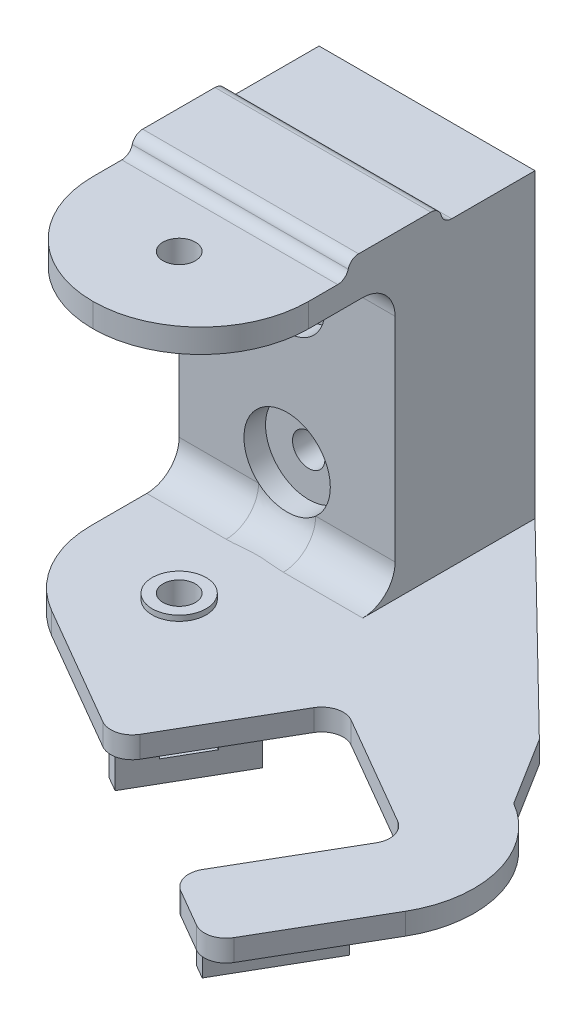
ISO-10303-21;
HEADER;
FILE_DESCRIPTION(('STEP AP214'),'2;1');
FILE_NAME('part.step','',(''),(''),'','','');
FILE_SCHEMA(('AUTOMOTIVE_DESIGN { 1 0 10303 214 1 1 1 1 }'));
ENDSEC;
DATA;
#1=APPLICATION_CONTEXT('core data for automotive mechanical design processes');
#2=APPLICATION_PROTOCOL_DEFINITION('international standard','automotive_design',2000,#1);
#3=PRODUCT_CONTEXT('',#1,'mechanical');
#4=PRODUCT('Part','Part','',(#3));
#5=PRODUCT_RELATED_PRODUCT_CATEGORY('part','',(#4));
#6=PRODUCT_DEFINITION_FORMATION('','',#4);
#7=PRODUCT_DEFINITION_CONTEXT('part definition',#1,'design');
#8=PRODUCT_DEFINITION('design','',#6,#7);
#9=PRODUCT_DEFINITION_SHAPE('','',#8);
#10=(LENGTH_UNIT() NAMED_UNIT(*) SI_UNIT(.MILLI.,.METRE.));
#11=(NAMED_UNIT(*) PLANE_ANGLE_UNIT() SI_UNIT($,.RADIAN.));
#12=(NAMED_UNIT(*) SI_UNIT($,.STERADIAN.) SOLID_ANGLE_UNIT());
#13=UNCERTAINTY_MEASURE_WITH_UNIT(LENGTH_MEASURE(1.E-05),#10,'distance_accuracy_value','');
#14=(GEOMETRIC_REPRESENTATION_CONTEXT(3) GLOBAL_UNCERTAINTY_ASSIGNED_CONTEXT((#13)) GLOBAL_UNIT_ASSIGNED_CONTEXT((#10,
#11,#12)) REPRESENTATION_CONTEXT('',''));
#15=CARTESIAN_POINT('',(0.,0.,0.));
#16=DIRECTION('',(0.,0.,1.));
#17=DIRECTION('',(1.,0.,0.));
#18=AXIS2_PLACEMENT_3D('',#15,#16,#17);
#19=CARTESIAN_POINT('',(10.,15.4092197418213,0.));
#20=DIRECTION('',(0.,-1.,0.));
#21=DIRECTION('',(0.,0.,-1.));
#22=AXIS2_PLACEMENT_3D('',#19,#20,#21);
#23=PLANE('',#22);
#24=DIRECTION('',(0.,0.,1.));
#25=VECTOR('',#24,1.);
#26=CARTESIAN_POINT('',(-10.,15.4092197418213,0.));
#27=LINE('',#26,#25);
#28=CARTESIAN_POINT('',(-10.,15.4092197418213,0.));
#29=VERTEX_POINT('',#28);
#30=CARTESIAN_POINT('',(-10.,15.4092197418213,7.7128891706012));
#31=VERTEX_POINT('',#30);
#32=EDGE_CURVE('E604',#29,#31,#27,.T.);
#33=ORIENTED_EDGE('',*,*,#32,.T.);
#34=DIRECTION('',(-1.,0.,0.));
#35=VECTOR('',#34,1.);
#36=CARTESIAN_POINT('',(10.,15.4092197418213,7.7128891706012));
#37=LINE('',#36,#35);
#38=CARTESIAN_POINT('',(10.,15.4092197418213,7.7128891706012));
#39=VERTEX_POINT('',#38);
#40=EDGE_CURVE('E1142',#31,#39,#37,.F.);
#41=ORIENTED_EDGE('',*,*,#40,.T.);
#42=DIRECTION('',(0.,0.,1.));
#43=VECTOR('',#42,1.);
#44=CARTESIAN_POINT('',(10.,15.4092197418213,0.));
#45=LINE('',#44,#43);
#46=CARTESIAN_POINT('',(10.,15.4092197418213,0.));
#47=VERTEX_POINT('',#46);
#48=EDGE_CURVE('E598',#47,#39,#45,.T.);
#49=ORIENTED_EDGE('',*,*,#48,.F.);
#50=DIRECTION('',(-1.,0.,0.));
#51=VECTOR('',#50,1.);
#52=CARTESIAN_POINT('',(10.,15.4092197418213,0.));
#53=LINE('',#52,#51);
#54=EDGE_CURVE('E601',#47,#29,#53,.T.);
#55=ORIENTED_EDGE('',*,*,#54,.T.);
#56=EDGE_LOOP('',(#33,#41,#49,#55));
#57=FACE_BOUND('',#56,.T.);
#58=ADVANCED_FACE('F38',(#57),#23,.F.);
#59=CARTESIAN_POINT('',(0.,15.4092197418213,22.9590263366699));
#60=DIRECTION('',(0.,-1.,0.));
#61=DIRECTION('',(0.,0.,-1.));
#62=AXIS2_PLACEMENT_3D('',#59,#60,#61);
#63=CIRCLE('',#62,1.5);
#64=CARTESIAN_POINT('',(0.,15.4092197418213,21.4590263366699));
#65=VERTEX_POINT('',#64);
#66=EDGE_CURVE('E552',#65,#65,#63,.T.);
#67=ORIENTED_EDGE('',*,*,#66,.T.);
#68=EDGE_LOOP('',(#67));
#69=FACE_BOUND('',#68,.T.);
#70=CARTESIAN_POINT('',(10.,15.4092197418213,18.2736619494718));
#71=VERTEX_POINT('',#70);
#72=CARTESIAN_POINT('',(10.,15.4092197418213,20.9590263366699));
#73=VERTEX_POINT('',#72);
#74=EDGE_CURVE('E596',#71,#73,#45,.T.);
#75=ORIENTED_EDGE('',*,*,#74,.F.);
#76=DIRECTION('',(1.,0.,0.));
#77=VECTOR('',#76,1.);
#78=CARTESIAN_POINT('',(-10.,15.4092197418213,18.2736619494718));
#79=LINE('',#78,#77);
#80=CARTESIAN_POINT('',(-10.,15.4092197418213,18.2736619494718));
#81=VERTEX_POINT('',#80);
#82=EDGE_CURVE('E830',#71,#81,#79,.F.);
#83=ORIENTED_EDGE('',*,*,#82,.T.);
#84=CARTESIAN_POINT('',(-10.,15.4092197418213,20.9590263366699));
#85=VERTEX_POINT('',#84);
#86=EDGE_CURVE('E603',#81,#85,#27,.T.);
#87=ORIENTED_EDGE('',*,*,#86,.T.);
#88=CARTESIAN_POINT('',(0.,15.4092197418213,20.9590263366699));
#89=DIRECTION('',(0.,-1.,0.));
#90=DIRECTION('',(0.,0.,-1.));
#91=AXIS2_PLACEMENT_3D('',#88,#89,#90);
#92=CIRCLE('',#91,10.);
#93=CARTESIAN_POINT('',(0.,15.4092197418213,30.9590263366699));
#94=VERTEX_POINT('',#93);
#95=EDGE_CURVE('E678',#85,#94,#92,.F.);
#96=ORIENTED_EDGE('',*,*,#95,.T.);
#97=CARTESIAN_POINT('',(0.,15.4092197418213,20.9590263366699));
#98=DIRECTION('',(0.,-1.,0.));
#99=DIRECTION('',(0.,0.,-1.));
#100=AXIS2_PLACEMENT_3D('',#97,#98,#99);
#101=CIRCLE('',#100,10.);
#102=EDGE_CURVE('E680',#94,#73,#101,.F.);
#103=ORIENTED_EDGE('',*,*,#102,.T.);
#104=EDGE_LOOP('',(#75,#83,#87,#96,#103));
#105=FACE_BOUND('',#104,.T.);
#106=ADVANCED_FACE('F853',(#69,#105),#23,.F.);
#107=CARTESIAN_POINT('',(32.2497170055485,-4.5,51.3681485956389));
#108=DIRECTION('',(0.501609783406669,0.,-0.865093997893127));
#109=DIRECTION('',(-0.865093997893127,0.,-0.501609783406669));
#110=AXIS2_PLACEMENT_3D('',#107,#108,#109);
#111=PLANE('',#110);
#112=DIRECTION('',(0.865093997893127,0.,0.501609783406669));
#113=VECTOR('',#112,1.);
#114=CARTESIAN_POINT('',(32.2497170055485,-14.5,51.3681485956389));
#115=LINE('',#114,#113);
#116=CARTESIAN_POINT('',(-5.0160978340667,-14.5,29.7602107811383));
#117=VERTEX_POINT('',#116);
#118=CARTESIAN_POINT('',(6.28261357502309,-14.5,36.311573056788));
#119=VERTEX_POINT('',#118);
#120=EDGE_CURVE('E468',#117,#119,#115,.T.);
#121=ORIENTED_EDGE('',*,*,#120,.T.);
#122=DIRECTION('',(0.,1.,0.));
#123=VECTOR('',#122,1.);
#124=CARTESIAN_POINT('',(6.28261357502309,-4.5,36.311573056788));
#125=LINE('',#124,#123);
#126=CARTESIAN_POINT('',(6.28261357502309,-12.5,36.311573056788));
#127=VERTEX_POINT('',#126);
#128=EDGE_CURVE('E713',#119,#127,#125,.T.);
#129=ORIENTED_EDGE('',*,*,#128,.T.);
#130=DIRECTION('',(-0.865093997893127,0.,-0.501609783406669));
#131=VECTOR('',#130,1.);
#132=CARTESIAN_POINT('',(-14.1762466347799,-12.5,24.4488570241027));
#133=LINE('',#132,#131);
#134=CARTESIAN_POINT('',(-5.01609783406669,-12.5,29.7602107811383));
#135=VERTEX_POINT('',#134);
#136=EDGE_CURVE('E471',#127,#135,#133,.T.);
#137=ORIENTED_EDGE('',*,*,#136,.T.);
#138=DIRECTION('',(0.,-1.,0.));
#139=VECTOR('',#138,1.);
#140=CARTESIAN_POINT('',(-5.01609783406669,-14.5,29.7602107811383));
#141=LINE('',#140,#139);
#142=EDGE_CURVE('E656',#135,#117,#141,.T.);
#143=ORIENTED_EDGE('',*,*,#142,.T.);
#144=EDGE_LOOP('',(#121,#129,#137,#143));
#145=FACE_BOUND('',#144,.T.);
#146=ADVANCED_FACE('F764',(#145),#111,.F.);
#147=CARTESIAN_POINT('',(0.,-12.5,0.));
#148=DIRECTION('',(0.,1.,0.));
#149=DIRECTION('',(0.,0.,1.));
#150=AXIS2_PLACEMENT_3D('',#147,#148,#149);
#151=PLANE('',#150);
#152=DIRECTION('',(0.,0.,-1.));
#153=VECTOR('',#152,1.);
#154=CARTESIAN_POINT('',(10.,-12.5,0.));
#155=LINE('',#154,#153);
#156=CARTESIAN_POINT('',(10.,-12.5,15.9594449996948));
#157=VERTEX_POINT('',#156);
#158=CARTESIAN_POINT('',(10.,-12.5,0.));
#159=VERTEX_POINT('',#158);
#160=EDGE_CURVE('E578',#157,#159,#155,.T.);
#161=ORIENTED_EDGE('',*,*,#160,.F.);
#162=DIRECTION('',(1.,0.,0.));
#163=VECTOR('',#162,1.);
#164=CARTESIAN_POINT('',(0.,-12.5,15.9594449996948));
#165=LINE('',#164,#163);
#166=CARTESIAN_POINT('',(2.64575131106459,-12.5,15.9594449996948));
#167=VERTEX_POINT('',#166);
#168=EDGE_CURVE('E752',#157,#167,#165,.F.);
#169=ORIENTED_EDGE('',*,*,#168,.T.);
#170=CARTESIAN_POINT('',(4.08988835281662,-12.5,15.7613002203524));
#171=CARTESIAN_POINT('',(2.99359639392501,-12.5,12.2084095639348));
#172=CARTESIAN_POINT('',(3.2253384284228,-8.86583854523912,12.9594449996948));
#173=CARTESIAN_POINT('',(3.96461712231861,-12.5,15.7999990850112));
#174=CARTESIAN_POINT('',(3.00520419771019,-12.5,12.2681308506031));
#175=CARTESIAN_POINT('',(3.19074528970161,-8.91287589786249,12.9594449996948));
#176=CARTESIAN_POINT('',(3.83749524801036,-12.5,15.8323017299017));
#177=CARTESIAN_POINT('',(3.00590600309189,-12.5,12.3329922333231));
#178=CARTESIAN_POINT('',(3.15261406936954,-8.96281162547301,12.9594449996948));
#179=CARTESIAN_POINT('',(3.58170271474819,-12.5,15.8851301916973));
#180=CARTESIAN_POINT('',(2.98372902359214,-12.5,12.4670310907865));
#181=CARTESIAN_POINT('',(3.06781139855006,-9.06772562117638,12.9594449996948));
#182=CARTESIAN_POINT('',(3.45304834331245,-12.5,15.9057341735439));
#183=CARTESIAN_POINT('',(2.96150367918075,-12.5,12.5359745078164));
#184=CARTESIAN_POINT('',(3.02119944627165,-9.12266750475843,12.9594449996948));
#185=CARTESIAN_POINT('',(3.25929948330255,-12.5,15.9289280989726));
#186=CARTESIAN_POINT('',(2.91013788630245,-12.5,12.640259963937));
#187=CARTESIAN_POINT('',(2.94349318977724,-9.2087478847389,12.9594449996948));
#188=CARTESIAN_POINT('',(3.19462731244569,-12.5,15.9353725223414));
#189=CARTESIAN_POINT('',(2.89026670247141,-12.5,12.6748500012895));
#190=CARTESIAN_POINT('',(2.91631151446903,-9.23803410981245,12.9594449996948));
#191=CARTESIAN_POINT('',(3.06508089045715,-12.5,15.9458942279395));
#192=CARTESIAN_POINT('',(2.84475742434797,-12.5,12.7436730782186));
#193=CARTESIAN_POINT('',(2.85908113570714,-9.29774404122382,12.9594449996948));
#194=CARTESIAN_POINT('',(3.00020662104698,-12.5,15.9499712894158));
#195=CARTESIAN_POINT('',(2.81918559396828,-12.5,12.7779019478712));
#196=CARTESIAN_POINT('',(2.82903216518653,-9.32816785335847,12.9594449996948));
#197=CARTESIAN_POINT('',(2.8702193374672,-12.5,15.9559579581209));
#198=CARTESIAN_POINT('',(2.76231335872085,-12.5,12.845640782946));
#199=CARTESIAN_POINT('',(2.76574023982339,-9.39009427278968,12.9594449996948));
#200=CARTESIAN_POINT('',(2.80510611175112,-12.5,15.9578627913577));
#201=CARTESIAN_POINT('',(2.73106583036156,-12.5,12.8791523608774));
#202=CARTESIAN_POINT('',(2.73249042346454,-9.42159910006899,12.9594449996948));
#203=CARTESIAN_POINT('',(2.67487659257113,-12.5,15.9597062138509));
#204=CARTESIAN_POINT('',(2.6630449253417,-12.5,12.9449795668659));
#205=CARTESIAN_POINT('',(2.66258889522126,-9.48544069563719,12.9594449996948));
#206=CARTESIAN_POINT('',(2.60976030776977,-12.5,15.959645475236));
#207=CARTESIAN_POINT('',(2.62633643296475,-12.5,12.9773045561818));
#208=CARTESIAN_POINT('',(2.62593835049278,-9.51777717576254,12.9594449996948));
#209=CARTESIAN_POINT('',(2.40729503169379,-12.5,15.9567545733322));
#210=CARTESIAN_POINT('',(2.50454248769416,-12.5,13.0748830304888));
#211=CARTESIAN_POINT('',(2.50620661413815,-9.61934487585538,12.9594449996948));
#212=CARTESIAN_POINT('',(2.26998834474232,-12.5,15.9509255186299));
#213=CARTESIAN_POINT('',(2.40985638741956,-12.5,13.1381899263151));
#214=CARTESIAN_POINT('',(2.41674011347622,-9.68969190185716,12.9594449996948));
#215=CARTESIAN_POINT('',(1.99569819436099,-12.5,15.9339262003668));
#216=CARTESIAN_POINT('',(2.19840837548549,-12.5,13.2553706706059));
#217=CARTESIAN_POINT('',(2.21874276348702,-9.83045368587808,12.9594449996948));
#218=CARTESIAN_POINT('',(1.85871487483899,-12.5,15.9227538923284));
#219=CARTESIAN_POINT('',(2.08203101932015,-12.5,13.3094814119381));
#220=CARTESIAN_POINT('',(2.11020462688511,-9.90086845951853,12.9594449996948));
#221=CARTESIAN_POINT('',(1.58484711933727,-12.5,15.8977614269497));
#222=CARTESIAN_POINT('',(1.82977698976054,-12.5,13.4066779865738));
#223=CARTESIAN_POINT('',(1.8719679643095,-10.0375968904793,12.9594449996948));
#224=CARTESIAN_POINT('',(1.44796297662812,-12.5,15.8839382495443));
#225=CARTESIAN_POINT('',(1.69402739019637,-12.5,13.4500528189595));
#226=CARTESIAN_POINT('',(1.74224532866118,-10.1039057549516,12.9594449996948));
#227=CARTESIAN_POINT('',(1.1741721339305,-12.5,15.8565956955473));
#228=CARTESIAN_POINT('',(1.40645047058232,-12.5,13.5248786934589));
#229=CARTESIAN_POINT('',(1.46136721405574,-10.2266376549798,12.9594449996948));
#230=CARTESIAN_POINT('',(1.03726543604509,-12.5,15.8430762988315));
#231=CARTESIAN_POINT('',(1.25444717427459,-12.5,13.5566420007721));
#232=CARTESIAN_POINT('',(1.31021315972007,-10.2830613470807,12.9594449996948));
#233=CARTESIAN_POINT('',(0.762533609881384,-12.5,15.8192222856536));
#234=CARTESIAN_POINT('',(0.937874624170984,-12.5,13.6081525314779));
#235=CARTESIAN_POINT('',(0.988334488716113,-10.3796195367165,12.9594449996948));
#236=CARTESIAN_POINT('',(0.624707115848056,-12.5,15.8089022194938));
#237=CARTESIAN_POINT('',(0.772674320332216,-12.5,13.6281159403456));
#238=CARTESIAN_POINT('',(0.817525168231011,-10.4196798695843,12.9594449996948));
#239=CARTESIAN_POINT('',(0.348753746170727,-12.5,15.7939712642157));
#240=CARTESIAN_POINT('',(0.435829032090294,-12.5,13.6559261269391));
#241=CARTESIAN_POINT('',(0.463669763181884,-10.4770624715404,12.9594449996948));
#242=CARTESIAN_POINT('',(0.210626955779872,-12.5,15.7893589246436));
#243=CARTESIAN_POINT('',(0.263257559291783,-12.5,13.6639439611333));
#244=CARTESIAN_POINT('',(0.280626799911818,-10.49439051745,12.9594449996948));
#245=CARTESIAN_POINT('',(-0.0657123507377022,-12.5,15.7870036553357));
#246=CARTESIAN_POINT('',(-0.0819541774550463,-12.5,13.6680744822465));
#247=CARTESIAN_POINT('',(-0.0874636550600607,-10.503277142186,12.9594449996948));
#248=CARTESIAN_POINT('',(-0.20392487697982,-12.5,15.7892618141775));
#249=CARTESIAN_POINT('',(-0.255705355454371,-12.5,13.6642118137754));
#250=CARTESIAN_POINT('',(-0.272511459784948,-10.4948316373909,12.9594449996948));
#251=CARTESIAN_POINT('',(-0.480114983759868,-12.5,15.8000740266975));
#252=CARTESIAN_POINT('',(-0.596904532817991,-12.5,13.6446901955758));
#253=CARTESIAN_POINT('',(-0.633671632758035,-10.4536796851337,12.9594449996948));
#254=CARTESIAN_POINT('',(-0.618092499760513,-12.5,15.8086295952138));
#255=CARTESIAN_POINT('',(-0.765371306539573,-12.5,13.6289066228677));
#256=CARTESIAN_POINT('',(-0.809781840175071,-10.4209674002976,12.9594449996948));
#257=CARTESIAN_POINT('',(-0.892267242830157,-12.5,15.8298478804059));
#258=CARTESIAN_POINT('',(-1.08899131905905,-12.5,13.5858237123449));
#259=CARTESIAN_POINT('',(-1.14310790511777,-10.3370105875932,12.9594449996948));
#260=CARTESIAN_POINT('',(-1.02846810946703,-12.5,15.8424671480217));
#261=CARTESIAN_POINT('',(-1.24497060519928,-12.5,13.5584088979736));
#262=CARTESIAN_POINT('',(-1.30050053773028,-10.2859614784,12.9594449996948));
#263=CARTESIAN_POINT('',(-1.30072574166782,-12.5,15.8690599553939));
#264=CARTESIAN_POINT('',(-1.54178327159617,-12.5,13.492263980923));
#265=CARTESIAN_POINT('',(-1.59459972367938,-10.171812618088,12.9594449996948));
#266=CARTESIAN_POINT('',(-1.43678250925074,-12.5,15.8830334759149));
#267=CARTESIAN_POINT('',(-1.6829228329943,-12.5,13.4532372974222));
#268=CARTESIAN_POINT('',(-1.73130657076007,-10.108713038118,12.9594449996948));
#269=CARTESIAN_POINT('',(-1.70867025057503,-12.5,15.909369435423));
#270=CARTESIAN_POINT('',(-1.94683228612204,-12.5,13.3645741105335));
#271=CARTESIAN_POINT('',(-1.98315439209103,-9.97667895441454,12.9594449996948));
#272=CARTESIAN_POINT('',(-1.84450075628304,-12.5,15.9217363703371));
#273=CARTESIAN_POINT('',(-2.06961967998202,-12.5,13.3146626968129));
#274=CARTESIAN_POINT('',(-2.09835596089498,-9.90776166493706,12.9594449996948));
#275=CARTESIAN_POINT('',(-2.11653013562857,-12.5,15.9421671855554));
#276=CARTESIAN_POINT('',(-2.29503316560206,-12.5,13.205347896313));
#277=CARTESIAN_POINT('',(-2.30918071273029,-9.76858617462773,12.9594449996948));
#278=CARTESIAN_POINT('',(-2.252729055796,-12.5,15.9502304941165));
#279=CARTESIAN_POINT('',(-2.39734873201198,-12.5,13.1456820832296));
#280=CARTESIAN_POINT('',(-2.40480129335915,-9.6983277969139,12.9594449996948));
#281=CARTESIAN_POINT('',(-2.52675115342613,-12.5,15.9596297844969));
#282=CARTESIAN_POINT('',(-2.58076049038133,-12.5,13.0182075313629));
#283=CARTESIAN_POINT('',(-2.57969956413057,-9.55904805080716,12.9594449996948));
#284=CARTESIAN_POINT('',(-2.66457705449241,-12.5,15.9608983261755));
#285=CARTESIAN_POINT('',(-2.66111439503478,-12.5,12.9501552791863));
#286=CARTESIAN_POINT('',(-2.65880595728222,-9.49004583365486,12.9594449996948));
#287=CARTESIAN_POINT('',(-2.93994288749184,-12.5,15.9543015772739));
#288=CARTESIAN_POINT('',(-2.79756973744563,-12.5,12.8094218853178));
#289=CARTESIAN_POINT('',(-2.80209334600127,-9.35619901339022,12.9594449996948));
#290=CARTESIAN_POINT('',(-3.07748295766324,-12.5,15.946443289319));
#291=CARTESIAN_POINT('',(-2.85308229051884,-12.5,12.7366774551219));
#292=CARTESIAN_POINT('',(-2.86628573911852,-9.29135126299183,12.9594449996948));
#293=CARTESIAN_POINT('',(-3.35412012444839,-12.5,15.9194424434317));
#294=CARTESIAN_POINT('',(-2.93976115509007,-12.5,12.5889608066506));
#295=CARTESIAN_POINT('',(-2.98344030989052,-9.16581903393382,12.9594449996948));
#296=CARTESIAN_POINT('',(-3.49319840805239,-12.5,15.9000921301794));
#297=CARTESIAN_POINT('',(-2.96976705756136,-12.5,12.5140755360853));
#298=CARTESIAN_POINT('',(-3.0361706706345,-9.10523477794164,12.9594449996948));
#299=CARTESIAN_POINT('',(-3.70017326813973,-12.5,15.8612269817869));
#300=CARTESIAN_POINT('',(-2.99502999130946,-12.5,12.4053066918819));
#301=CARTESIAN_POINT('',(-3.10747988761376,-9.0189197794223,12.9594449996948));
#302=CARTESIAN_POINT('',(-3.7690042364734,-12.5,15.8465994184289));
#303=CARTESIAN_POINT('',(-3.00010392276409,-12.5,12.3693214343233));
#304=CARTESIAN_POINT('',(-3.12998281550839,-8.99086550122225,12.9594449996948));
#305=CARTESIAN_POINT('',(-3.90586802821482,-12.5,15.813889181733));
#306=CARTESIAN_POINT('',(-3.00372773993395,-12.5,12.2990534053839));
#307=CARTESIAN_POINT('',(-3.17261584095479,-8.93632945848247,12.9594449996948));
#308=CARTESIAN_POINT('',(-3.97390051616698,-12.5,15.7958051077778));
#309=CARTESIAN_POINT('',(-3.00220104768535,-12.5,12.2648070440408));
#310=CARTESIAN_POINT('',(-3.19274497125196,-8.90984833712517,12.9594449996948));
#311=CARTESIAN_POINT('',(-4.04142087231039,-12.5,15.7759147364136));
#312=CARTESIAN_POINT('',(-2.99752383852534,-12.5,12.2319521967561));
#313=CARTESIAN_POINT('',(-3.21181153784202,-8.88417001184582,12.9594449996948));
#314=(BOUNDED_SURFACE() B_SPLINE_SURFACE(3,2,((#170,#171,#172),(#173,#174,#175),(#176,#177,
#178),(#179,#180,#181),(#182,#183,#184),(#185,#186,#187),(#188,#189,#190),(#191,#192,#193),
(#194,#195,#196),(#197,#198,#199),(#200,#201,#202),(#203,#204,#205),(#206,#207,#208),(#209,#210,
#211),(#212,#213,#214),(#215,#216,#217),(#218,#219,#220),(#221,#222,#223),(#224,#225,#226),
(#227,#228,#229),(#230,#231,#232),(#233,#234,#235),(#236,#237,#238),(#239,#240,#241),(#242,#243,
#244),(#245,#246,#247),(#248,#249,#250),(#251,#252,#253),(#254,#255,#256),(#257,#258,#259),
(#260,#261,#262),(#263,#264,#265),(#266,#267,#268),(#269,#270,#271),(#272,#273,#274),(#275,#276,
#277),(#278,#279,#280),(#281,#282,#283),(#284,#285,#286),(#287,#288,#289),(#290,#291,#292),
(#293,#294,#295),(#296,#297,#298),(#299,#300,#301),(#302,#303,#304),(#305,#306,#307),(#308,#309,
#310),(#311,#312,#313)),.UNSPECIFIED.,.F.,.F.,.F.) B_SPLINE_SURFACE_WITH_KNOTS((4,2,2,2,2,2,2,2,
2,2,2,2,2,2,2,2,2,2,2,2,2,2,2,4),(3,3),(0.,0.393010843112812,0.783363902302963,
0.978308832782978,1.17327193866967,1.36866270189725,1.56398665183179,1.97609542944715,
2.38836201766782,2.80110111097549,3.21381278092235,3.62837479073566,4.04283142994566,
4.45735374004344,4.8719757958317,5.28230423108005,5.6926268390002,6.10177524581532,
6.51097799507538,6.92423478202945,7.3371747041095,7.75781734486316,7.96884182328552,
8.17995199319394),(0.,1.),
.UNSPECIFIED.) GEOMETRIC_REPRESENTATION_ITEM() RATIONAL_B_SPLINE_SURFACE(((1.,0.627938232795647,
1.),(1.,0.634182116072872,1.),(1.,0.640714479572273,1.),(1.,0.654216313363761,1.),(1.,
0.661182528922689,1.),(1.,0.671915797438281,1.),(1.,0.675538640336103,1.),(1.,0.682864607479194,
1.),(1.,0.686567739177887,1.),(1.,0.69404349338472,1.),(1.,0.69781625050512,1.),(1.,
0.705399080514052,1.),(1.,0.709209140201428,1.),(1.,0.721079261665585,1.),(1.,0.72916298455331,
1.),(1.,0.745076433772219,1.),(1.,0.752906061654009,1.),(1.,0.767890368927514,1.),(1.,
0.775044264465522,1.),(1.,0.78813022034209,1.),(1.,0.794062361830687,1.),(1.,0.804132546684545,
1.),(1.,0.808262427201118,1.),(1.,0.814157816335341,1.),(1.,0.815923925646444,1.),(1.,
0.816831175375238,1.),(1.,0.815971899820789,1.),(1.,0.81175773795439,1.),(1.,0.808402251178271,
1.),(1.,0.799699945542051,1.),(1.,0.794374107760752,1.),(1.,0.782307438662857,1.),(1.,
0.775566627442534,1.),(1.,0.76124739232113,1.),(1.,0.753671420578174,1.),(1.,0.738122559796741,
1.),(1.,0.730149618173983,1.),(1.,0.714077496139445,1.),(1.,0.705977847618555,1.),(1.,
0.689997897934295,1.),(1.,0.682117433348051,1.),(1.,0.666606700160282,1.),(1.,0.658983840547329,
1.),(1.,0.647945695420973,1.),(1.,0.644326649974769,1.),(1.,0.637234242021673,1.),(1.,
0.633760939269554,1.),(1.,0.630366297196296,1.))) REPRESENTATION_ITEM('') SURFACE());
#315=CARTESIAN_POINT('',(4.08988835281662,-12.5,15.7613002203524));
#316=CARTESIAN_POINT('',(3.96461712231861,-12.5,15.7999990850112));
#317=CARTESIAN_POINT('',(3.83749524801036,-12.5,15.8323017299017));
#318=CARTESIAN_POINT('',(3.58170271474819,-12.5,15.8851301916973));
#319=CARTESIAN_POINT('',(3.45304834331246,-12.5,15.9057341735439));
#320=CARTESIAN_POINT('',(3.25929948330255,-12.5,15.9289280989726));
#321=CARTESIAN_POINT('',(3.19462731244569,-12.5,15.9353725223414));
#322=CARTESIAN_POINT('',(3.06508089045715,-12.5,15.9458942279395));
#323=CARTESIAN_POINT('',(3.00020662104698,-12.5,15.9499712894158));
#324=CARTESIAN_POINT('',(2.8702193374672,-12.5,15.955957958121));
#325=CARTESIAN_POINT('',(2.80510611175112,-12.5,15.9578627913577));
#326=CARTESIAN_POINT('',(2.67487659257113,-12.5,15.9597062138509));
#327=CARTESIAN_POINT('',(2.60976030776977,-12.5,15.959645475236));
#328=CARTESIAN_POINT('',(2.40729503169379,-12.5,15.9567545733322));
#329=CARTESIAN_POINT('',(2.26998834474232,-12.5,15.9509255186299));
#330=CARTESIAN_POINT('',(1.99569819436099,-12.5,15.9339262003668));
#331=CARTESIAN_POINT('',(1.85871487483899,-12.5,15.9227538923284));
#332=CARTESIAN_POINT('',(1.58484711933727,-12.5,15.8977614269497));
#333=CARTESIAN_POINT('',(1.44796297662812,-12.5,15.8839382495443));
#334=CARTESIAN_POINT('',(1.1741721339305,-12.5,15.8565956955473));
#335=CARTESIAN_POINT('',(1.03726543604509,-12.5,15.8430762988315));
#336=CARTESIAN_POINT('',(0.762533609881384,-12.5,15.8192222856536));
#337=CARTESIAN_POINT('',(0.624707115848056,-12.5,15.8089022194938));
#338=CARTESIAN_POINT('',(0.348753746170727,-12.5,15.7939712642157));
#339=CARTESIAN_POINT('',(0.210626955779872,-12.5,15.7893589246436));
#340=CARTESIAN_POINT('',(-0.0657123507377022,-12.5,15.7870036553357));
#341=CARTESIAN_POINT('',(-0.20392487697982,-12.5,15.7892618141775));
#342=CARTESIAN_POINT('',(-0.480114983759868,-12.5,15.8000740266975));
#343=CARTESIAN_POINT('',(-0.618092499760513,-12.5,15.8086295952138));
#344=CARTESIAN_POINT('',(-0.892267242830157,-12.5,15.8298478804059));
#345=CARTESIAN_POINT('',(-1.02846810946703,-12.5,15.8424671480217));
#346=CARTESIAN_POINT('',(-1.30072574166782,-12.5,15.8690599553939));
#347=CARTESIAN_POINT('',(-1.43678250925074,-12.5,15.8830334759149));
#348=CARTESIAN_POINT('',(-1.70867025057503,-12.5,15.909369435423));
#349=CARTESIAN_POINT('',(-1.84450075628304,-12.5,15.9217363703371));
#350=CARTESIAN_POINT('',(-2.11653013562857,-12.5,15.9421671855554));
#351=CARTESIAN_POINT('',(-2.252729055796,-12.5,15.9502304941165));
#352=CARTESIAN_POINT('',(-2.52675115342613,-12.5,15.9596297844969));
#353=CARTESIAN_POINT('',(-2.66457705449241,-12.5,15.9608983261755));
#354=CARTESIAN_POINT('',(-2.93994288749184,-12.5,15.9543015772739));
#355=CARTESIAN_POINT('',(-3.07748295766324,-12.5,15.946443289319));
#356=CARTESIAN_POINT('',(-3.35412012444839,-12.5,15.9194424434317));
#357=CARTESIAN_POINT('',(-3.49319840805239,-12.5,15.9000921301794));
#358=CARTESIAN_POINT('',(-3.70017326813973,-12.5,15.8612269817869));
#359=CARTESIAN_POINT('',(-3.7690042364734,-12.5,15.8465994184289));
#360=CARTESIAN_POINT('',(-3.90586802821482,-12.5,15.813889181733));
#361=CARTESIAN_POINT('',(-3.97390051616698,-12.5,15.7958051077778));
#362=CARTESIAN_POINT('',(-4.04142087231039,-12.5,15.7759147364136));
#363=B_SPLINE_CURVE_WITH_KNOTS('',3,(#315,#316,#317,#318,#319,#320,#321,#322,#323,#324,#325,
#326,#327,#328,#329,#330,#331,#332,#333,#334,#335,#336,#337,#338,#339,#340,#341,#342,#343,#344,
#345,#346,#347,#348,#349,#350,#351,#352,#353,#354,#355,#356,#357,#358,#359,#360,#361,#362),
.UNSPECIFIED.,.F.,.F.,(4,2,2,2,2,2,2,2,2,2,2,2,2,2,2,2,2,2,2,2,2,2,2,4),(0.,0.393010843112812,
0.783363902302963,0.978308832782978,1.17327193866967,1.36866270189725,1.56398665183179,
1.97609542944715,2.38836201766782,2.80110111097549,3.21381278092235,3.62837479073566,
4.04283142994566,4.45735374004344,4.8719757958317,5.28230423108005,5.6926268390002,
6.10177524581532,6.51097799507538,6.92423478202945,7.3371747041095,7.75781734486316,
7.96884182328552,8.17995199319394),.UNSPECIFIED.);
#364=CARTESIAN_POINT('',(-2.64575131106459,-12.5,15.9594449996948));
#365=VERTEX_POINT('',#364);
#366=EDGE_CURVE('E744',#167,#365,#363,.T.);
#367=ORIENTED_EDGE('',*,*,#366,.T.);
#368=DIRECTION('',(1.,0.,0.));
#369=VECTOR('',#368,1.);
#370=CARTESIAN_POINT('',(0.,-12.5,15.9594449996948));
#371=LINE('',#370,#369);
#372=CARTESIAN_POINT('',(-10.,-12.5,15.9594449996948));
#373=VERTEX_POINT('',#372);
#374=EDGE_CURVE('E742',#365,#373,#371,.F.);
#375=ORIENTED_EDGE('',*,*,#374,.T.);
#376=DIRECTION('',(0.,0.,1.));
#377=VECTOR('',#376,1.);
#378=CARTESIAN_POINT('',(-10.,-12.5,0.));
#379=LINE('',#378,#377);
#380=CARTESIAN_POINT('',(-10.,-12.5,21.1092708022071));
#381=VERTEX_POINT('',#380);
#382=EDGE_CURVE('E560',#373,#381,#379,.T.);
#383=ORIENTED_EDGE('',*,*,#382,.T.);
#384=CARTESIAN_POINT('',(0.,-12.5,21.1092708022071));
#385=DIRECTION('',(0.,1.,0.));
#386=DIRECTION('',(0.,0.,1.));
#387=AXIS2_PLACEMENT_3D('',#384,#385,#386);
#388=CIRCLE('',#387,10.);
#389=EDGE_CURVE('E667',#381,#135,#388,.T.);
#390=ORIENTED_EDGE('',*,*,#389,.T.);
#391=ORIENTED_EDGE('',*,*,#136,.F.);
#392=CARTESIAN_POINT('',(7.28583314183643,-12.5,34.5813850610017));
#393=DIRECTION('',(0.,1.,0.));
#394=DIRECTION('',(0.,0.,1.));
#395=AXIS2_PLACEMENT_3D('',#392,#393,#394);
#396=CIRCLE('',#395,2.);
#397=CARTESIAN_POINT('',(9.01602113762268,-12.5,35.5846046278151));
#398=VERTEX_POINT('',#397);
#399=EDGE_CURVE('E694',#127,#398,#396,.T.);
#400=ORIENTED_EDGE('',*,*,#399,.T.);
#401=DIRECTION('',(-0.501609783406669,0.,0.865093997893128));
#402=VECTOR('',#401,1.);
#403=CARTESIAN_POINT('',(22.1890482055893,-12.5,12.8659355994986));
#404=LINE('',#403,#402);
#405=CARTESIAN_POINT('',(14.9171476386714,-12.5,25.407312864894));
#406=VERTEX_POINT('',#405);
#407=EDGE_CURVE('E923',#406,#398,#404,.T.);
#408=ORIENTED_EDGE('',*,*,#407,.F.);
#409=CARTESIAN_POINT('',(16.6473356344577,-12.5,26.4105324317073));
#410=DIRECTION('',(0.,1.,0.));
#411=DIRECTION('',(0.,0.,1.));
#412=AXIS2_PLACEMENT_3D('',#409,#410,#411);
#413=CIRCLE('',#412,2.);
#414=CARTESIAN_POINT('',(17.650555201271,-12.5,24.6803444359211));
#415=VERTEX_POINT('',#414);
#416=EDGE_CURVE('E727',#406,#415,#413,.F.);
#417=ORIENTED_EDGE('',*,*,#416,.T.);
#418=DIRECTION('',(-0.865093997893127,0.,-0.50160978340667));
#419=VECTOR('',#418,1.);
#420=CARTESIAN_POINT('',(-6.26868100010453,-12.5,10.8111892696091));
#421=LINE('',#420,#419);
#422=CARTESIAN_POINT('',(27.9222269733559,-12.5,30.6361955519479));
#423=VERTEX_POINT('',#422);
#424=EDGE_CURVE('E688',#423,#415,#421,.T.);
#425=ORIENTED_EDGE('',*,*,#424,.F.);
#426=CARTESIAN_POINT('',(26.9190074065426,-12.5,32.3663835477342));
#427=DIRECTION('',(0.,1.,0.));
#428=DIRECTION('',(0.,0.,1.));
#429=AXIS2_PLACEMENT_3D('',#426,#427,#428);
#430=CIRCLE('',#429,2.);
#431=CARTESIAN_POINT('',(28.6491954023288,-12.5,33.3696031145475));
#432=VERTEX_POINT('',#431);
#433=EDGE_CURVE('E731',#423,#432,#430,.F.);
#434=ORIENTED_EDGE('',*,*,#433,.T.);
#435=DIRECTION('',(0.50160978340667,0.,-0.865093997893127));
#436=VECTOR('',#435,1.);
#437=CARTESIAN_POINT('',(35.9210959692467,-12.5,20.8282258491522));
#438=LINE('',#437,#436);
#439=CARTESIAN_POINT('',(22.7480689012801,-12.5,43.5468948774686));
#440=VERTEX_POINT('',#439);
#441=EDGE_CURVE('E915',#440,#432,#438,.T.);
#442=ORIENTED_EDGE('',*,*,#441,.F.);
#443=CARTESIAN_POINT('',(24.4782568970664,-12.5,44.5501144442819));
#444=DIRECTION('',(0.,1.,0.));
#445=DIRECTION('',(0.,0.,1.));
#446=AXIS2_PLACEMENT_3D('',#443,#444,#445);
#447=CIRCLE('',#446,2.);
#448=CARTESIAN_POINT('',(23.475037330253,-12.5,46.2803024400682));
#449=VERTEX_POINT('',#448);
#450=EDGE_CURVE('E696',#440,#449,#447,.T.);
#451=ORIENTED_EDGE('',*,*,#450,.T.);
#452=CARTESIAN_POINT('',(26.9298288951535,-12.5,48.2835035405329));
#453=VERTEX_POINT('',#452);
#454=EDGE_CURVE('E473',#453,#449,#133,.T.);
#455=ORIENTED_EDGE('',*,*,#454,.F.);
#456=CARTESIAN_POINT('',(27.9330484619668,-12.5,46.5533155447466));
#457=DIRECTION('',(0.,1.,0.));
#458=DIRECTION('',(0.,0.,1.));
#459=AXIS2_PLACEMENT_3D('',#456,#457,#458);
#460=CIRCLE('',#459,2.);
#461=CARTESIAN_POINT('',(29.6632364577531,-12.5,47.55653511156));
#462=VERTEX_POINT('',#461);
#463=EDGE_CURVE('E698',#453,#462,#460,.T.);
#464=ORIENTED_EDGE('',*,*,#463,.T.);
#465=DIRECTION('',(-0.501609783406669,0.,0.865093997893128));
#466=VECTOR('',#465,1.);
#467=CARTESIAN_POINT('',(40.510799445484,-12.5,28.8484437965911));
#468=LINE('',#467,#466);
#469=CARTESIAN_POINT('',(35.4947016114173,-12.5,37.4993837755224));
#470=VERTEX_POINT('',#469);
#471=EDGE_CURVE('E538',#470,#462,#468,.T.);
#472=ORIENTED_EDGE('',*,*,#471,.F.);
#473=CARTESIAN_POINT('',(26.843761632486,-12.5,32.4832859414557));
#474=DIRECTION('',(0.,1.,0.));
#475=DIRECTION('',(0.,0.,1.));
#476=AXIS2_PLACEMENT_3D('',#473,#474,#475);
#477=CIRCLE('',#476,10.);
#478=CARTESIAN_POINT('',(31.8598594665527,-12.5,23.8323459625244));
#479=VERTEX_POINT('',#478);
#480=EDGE_CURVE('E620',#470,#479,#477,.T.);
#481=ORIENTED_EDGE('',*,*,#480,.T.);
#482=DIRECTION('',(-0.529534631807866,0.,-0.848288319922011));
#483=VECTOR('',#482,1.);
#484=CARTESIAN_POINT('',(31.8598594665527,-12.5,23.8323459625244));
#485=LINE('',#484,#483);
#486=CARTESIAN_POINT('',(27.9156932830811,-12.5,17.5139865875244));
#487=VERTEX_POINT('',#486);
#488=EDGE_CURVE('E555',#479,#487,#485,.T.);
#489=ORIENTED_EDGE('',*,*,#488,.T.);
#490=DIRECTION('',(-0.715078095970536,0.,-0.699044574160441));
#491=VECTOR('',#490,1.);
#492=CARTESIAN_POINT('',(27.9156932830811,-12.5,17.5139865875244));
#493=LINE('',#492,#491);
#494=EDGE_CURVE('E572',#487,#159,#493,.T.);
#495=ORIENTED_EDGE('',*,*,#494,.T.);
#496=EDGE_LOOP('',(#161,#169,#367,#375,#383,#390,#391,#400,#408,#417,#425,#434,#442,#451,#455,
#464,#472,#481,#489,#495));
#497=FACE_BOUND('',#496,.T.);
#498=CARTESIAN_POINT('',(0.,-12.5,22.9590263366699));
#499=DIRECTION('',(0.,1.,0.));
#500=DIRECTION('',(0.,0.,1.));
#501=AXIS2_PLACEMENT_3D('',#498,#499,#500);
#502=CIRCLE('',#501,2.5);
#503=CARTESIAN_POINT('',(0.,-12.5,25.4590263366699));
#504=VERTEX_POINT('',#503);
#505=EDGE_CURVE('E477',#504,#504,#502,.T.);
#506=ORIENTED_EDGE('',*,*,#505,.F.);
#507=EDGE_LOOP('',(#506));
#508=FACE_BOUND('',#507,.T.);
#509=ADVANCED_FACE('F758',(#497,#508),#151,.T.);
#510=CARTESIAN_POINT('',(0.,-6.5,24.));
#511=DIRECTION('',(0.,0.,-1.));
#512=DIRECTION('',(0.,1.,0.));
#513=AXIS2_PLACEMENT_3D('',#510,#511,#512);
#514=CYLINDRICAL_SURFACE('',#513,1.5);
#515=CARTESIAN_POINT('',(0.,-6.5,9.));
#516=DIRECTION('',(0.,0.,-1.));
#517=DIRECTION('',(0.,-1.,0.));
#518=AXIS2_PLACEMENT_3D('',#515,#516,#517);
#519=CIRCLE('',#518,1.5);
#520=CARTESIAN_POINT('',(0.,-8.,9.));
#521=VERTEX_POINT('',#520);
#522=EDGE_CURVE('E502',#521,#521,#519,.T.);
#523=ORIENTED_EDGE('',*,*,#522,.T.);
#524=EDGE_LOOP('',(#523));
#525=FACE_BOUND('',#524,.T.);
#526=CARTESIAN_POINT('',(0.,-6.5,10.9594449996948));
#527=DIRECTION('',(0.,0.,1.));
#528=DIRECTION('',(1.,0.,0.));
#529=AXIS2_PLACEMENT_3D('',#526,#527,#528);
#530=CIRCLE('',#529,1.5);
#531=CARTESIAN_POINT('',(1.5,-6.5,10.9594449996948));
#532=VERTEX_POINT('',#531);
#533=EDGE_CURVE('E505',#532,#532,#530,.F.);
#534=ORIENTED_EDGE('',*,*,#533,.F.);
#535=EDGE_LOOP('',(#534));
#536=FACE_BOUND('',#535,.T.);
#537=ADVANCED_FACE('F763',(#525,#536),#514,.F.);
#538=CARTESIAN_POINT('',(0.,7.40921974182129,24.));
#539=DIRECTION('',(0.,0.,-1.));
#540=DIRECTION('',(0.,1.,0.));
#541=AXIS2_PLACEMENT_3D('',#538,#539,#540);
#542=CYLINDRICAL_SURFACE('',#541,1.5);
#543=CARTESIAN_POINT('',(0.,7.40921974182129,9.));
#544=DIRECTION('',(0.,0.,-1.));
#545=DIRECTION('',(0.,1.,0.));
#546=AXIS2_PLACEMENT_3D('',#543,#544,#545);
#547=CIRCLE('',#546,1.5);
#548=CARTESIAN_POINT('',(0.,8.90921974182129,9.));
#549=VERTEX_POINT('',#548);
#550=EDGE_CURVE('E498',#549,#549,#547,.T.);
#551=ORIENTED_EDGE('',*,*,#550,.T.);
#552=EDGE_LOOP('',(#551));
#553=FACE_BOUND('',#552,.T.);
#554=CARTESIAN_POINT('',(0.,7.40921974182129,10.9594449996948));
#555=DIRECTION('',(0.,0.,1.));
#556=DIRECTION('',(1.,0.,0.));
#557=AXIS2_PLACEMENT_3D('',#554,#555,#556);
#558=CIRCLE('',#557,1.5);
#559=CARTESIAN_POINT('',(1.5,7.40921974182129,10.9594449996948));
#560=VERTEX_POINT('',#559);
#561=EDGE_CURVE('E487',#560,#560,#558,.F.);
#562=ORIENTED_EDGE('',*,*,#561,.F.);
#563=EDGE_LOOP('',(#562));
#564=FACE_BOUND('',#563,.T.);
#565=ADVANCED_FACE('F1037',(#553,#564),#542,.F.);
#566=CARTESIAN_POINT('',(-10.,13.2092197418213,12.9594449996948));
#567=DIRECTION('',(0.,1.,0.));
#568=DIRECTION('',(0.,0.,1.));
#569=AXIS2_PLACEMENT_3D('',#566,#567,#568);
#570=PLANE('',#569);
#571=DIRECTION('',(0.,0.,1.));
#572=VECTOR('',#571,1.);
#573=CARTESIAN_POINT('',(-10.,13.2092197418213,12.9594449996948));
#574=LINE('',#573,#572);
#575=CARTESIAN_POINT('',(-10.,13.2092197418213,15.9594449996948));
#576=VERTEX_POINT('',#575);
#577=CARTESIAN_POINT('',(-10.,13.2092197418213,20.9590263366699));
#578=VERTEX_POINT('',#577);
#579=EDGE_CURVE('E587',#576,#578,#574,.T.);
#580=ORIENTED_EDGE('',*,*,#579,.F.);
#581=DIRECTION('',(1.,0.,0.));
#582=VECTOR('',#581,1.);
#583=CARTESIAN_POINT('',(10.,13.2092197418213,15.9594449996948));
#584=LINE('',#583,#582);
#585=CARTESIAN_POINT('',(-2.1,13.2092197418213,15.9594449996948));
#586=VERTEX_POINT('',#585);
#587=EDGE_CURVE('E1196',#576,#586,#584,.T.);
#588=ORIENTED_EDGE('',*,*,#587,.T.);
#589=CARTESIAN_POINT('',(-3.63787422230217,13.2092197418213,15.7541664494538));
#590=CARTESIAN_POINT('',(-2.52732468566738,13.2092197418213,12.163165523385));
#591=CARTESIAN_POINT('',(-2.77358132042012,9.54399060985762,12.9594449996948));
#592=CARTESIAN_POINT('',(-3.57349638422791,13.2092197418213,15.7740779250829));
#593=CARTESIAN_POINT('',(-2.53346271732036,13.2092197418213,12.1938195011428));
#594=CARTESIAN_POINT('',(-2.75531849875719,9.56771088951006,12.9594449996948));
#595=CARTESIAN_POINT('',(-3.5086234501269,13.2092197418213,15.792331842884));
#596=CARTESIAN_POINT('',(-2.53663989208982,13.2092197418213,12.2258981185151));
#597=CARTESIAN_POINT('',(-2.73600842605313,9.59217803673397,12.9594449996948));
#598=CARTESIAN_POINT('',(-3.37809322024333,13.2092197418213,15.8256709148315));
#599=CARTESIAN_POINT('',(-2.53664658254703,13.2092197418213,12.2919864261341));
#600=CARTESIAN_POINT('',(-2.69503583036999,9.64256740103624,12.9594449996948));
#601=CARTESIAN_POINT('',(-3.31243623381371,13.2092197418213,15.8407572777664));
#602=CARTESIAN_POINT('',(-2.53354418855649,13.2092197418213,12.3259606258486));
#603=CARTESIAN_POINT('',(-2.67337420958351,9.66848905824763,12.9594449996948));
#604=CARTESIAN_POINT('',(-3.11496748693,13.2092197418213,15.8814137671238));
#605=CARTESIAN_POINT('',(-2.51455667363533,13.2092197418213,12.4290647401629));
#606=CARTESIAN_POINT('',(-2.60460812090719,9.7482265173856,12.9594449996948));
#607=CARTESIAN_POINT('',(-2.98222212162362,13.2092197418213,15.9025131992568));
#608=CARTESIAN_POINT('',(-2.48926147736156,13.2092197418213,12.5005255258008));
#609=CARTESIAN_POINT('',(-2.55360299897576,9.80417490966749,12.9594449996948));
#610=CARTESIAN_POINT('',(-2.71609823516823,13.2092197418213,15.9342349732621));
#611=CARTESIAN_POINT('',(-2.41199212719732,13.2092197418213,12.6433824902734));
#612=CARTESIAN_POINT('',(-2.43902919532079,9.92075250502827,12.9594449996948));
#613=CARTESIAN_POINT('',(-2.58272448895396,13.2092197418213,15.9448996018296));
#614=CARTESIAN_POINT('',(-2.36074435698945,13.2092197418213,12.7146890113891));
#615=CARTESIAN_POINT('',(-2.3755124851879,9.9813617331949,12.9594449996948));
#616=CARTESIAN_POINT('',(-2.38233449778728,13.2092197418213,15.9546037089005));
#617=CARTESIAN_POINT('',(-2.26392388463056,13.2092197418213,12.8190838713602));
#618=CARTESIAN_POINT('',(-2.26869841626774,10.0747839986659,12.9594449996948));
#619=CARTESIAN_POINT('',(-2.31544686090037,13.2092197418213,15.9567890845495));
#620=CARTESIAN_POINT('',(-2.22867737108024,13.2092197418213,12.8531974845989));
#621=CARTESIAN_POINT('',(-2.23114724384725,10.1063604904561,12.9594449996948));
#622=CARTESIAN_POINT('',(-2.18164036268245,13.2092197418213,15.959334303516));
#623=CARTESIAN_POINT('',(-2.15198568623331,13.2092197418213,12.919900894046));
#624=CARTESIAN_POINT('',(-2.15186528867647,10.1700274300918,12.9594449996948));
#625=CARTESIAN_POINT('',(-2.11472150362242,13.2092197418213,15.9596942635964));
#626=CARTESIAN_POINT('',(-2.11060756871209,13.2092197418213,12.9525071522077));
#627=CARTESIAN_POINT('',(-2.11013477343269,10.2021178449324,12.9594449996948));
#628=CARTESIAN_POINT('',(-1.90191512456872,13.2092197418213,15.9583900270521));
#629=CARTESIAN_POINT('',(-1.97034800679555,13.2092197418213,13.0524895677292));
#630=CARTESIAN_POINT('',(-1.97023598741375,10.3044464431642,12.9594449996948));
#631=CARTESIAN_POINT('',(-1.75605031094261,13.2092197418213,15.9538351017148));
#632=CARTESIAN_POINT('',(-1.85975423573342,13.2092197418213,13.1170259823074));
#633=CARTESIAN_POINT('',(-1.8635915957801,10.3750030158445,12.9594449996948));
#634=CARTESIAN_POINT('',(-1.46448460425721,13.2092197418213,15.9407072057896));
#635=CARTESIAN_POINT('',(-1.61310057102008,13.2092197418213,13.2330948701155));
#636=CARTESIAN_POINT('',(-1.62614186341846,10.5115300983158,12.9594449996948));
#637=CARTESIAN_POINT('',(-1.31878380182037,13.2092197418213,15.9321326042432));
#638=CARTESIAN_POINT('',(-1.4772997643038,13.2092197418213,13.2850124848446));
#639=CARTESIAN_POINT('',(-1.49532672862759,10.5774987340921,12.9594449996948));
#640=CARTESIAN_POINT('',(-1.10032742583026,13.2092197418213,15.9189117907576));
#641=CARTESIAN_POINT('',(-1.25748364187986,13.2092197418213,13.3515744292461));
#642=CARTESIAN_POINT('',(-1.2811112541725,10.667246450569,12.9594449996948));
#643=CARTESIAN_POINT('',(-1.02756007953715,13.2092197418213,15.9144473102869));
#644=CARTESIAN_POINT('',(-1.18200480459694,13.2092197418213,13.3718081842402));
#645=CARTESIAN_POINT('',(-1.20674814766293,10.6956164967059,12.9594449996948));
#646=CARTESIAN_POINT('',(-0.882007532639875,13.2092197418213,15.9058237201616));
#647=CARTESIAN_POINT('',(-1.02676489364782,13.2092197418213,13.4082871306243));
#648=CARTESIAN_POINT('',(-1.05247460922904,10.7482220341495,12.9594449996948));
#649=CARTESIAN_POINT('',(-0.809222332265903,13.2092197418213,15.9016646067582));
#650=CARTESIAN_POINT('',(-0.946938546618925,13.2092197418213,13.4245848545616));
#651=CARTESIAN_POINT('',(-0.972564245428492,10.7724575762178,12.9594449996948));
#652=CARTESIAN_POINT('',(-0.663638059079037,13.2092197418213,15.8940434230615));
#653=CARTESIAN_POINT('',(-0.783879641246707,13.2092197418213,13.4530379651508));
#654=CARTESIAN_POINT('',(-0.807957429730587,10.8157487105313,12.9594449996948));
#655=CARTESIAN_POINT('',(-0.590838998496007,13.2092197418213,15.8905811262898));
#656=CARTESIAN_POINT('',(-0.700547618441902,13.2092197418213,13.4652406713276));
#657=CARTESIAN_POINT('',(-0.723262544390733,10.8348059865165,12.9594449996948));
#658=CARTESIAN_POINT('',(-0.445198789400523,13.2092197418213,15.8846776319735));
#659=CARTESIAN_POINT('',(-0.531435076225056,13.2092197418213,13.4854127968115));
#660=CARTESIAN_POINT('',(-0.550174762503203,10.8668273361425,12.9594449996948));
#661=CARTESIAN_POINT('',(-0.372357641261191,13.2092197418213,15.8822364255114));
#662=CARTESIAN_POINT('',(-0.445522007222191,13.2092197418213,13.493417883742));
#663=CARTESIAN_POINT('',(-0.461781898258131,10.8797914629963,12.9594449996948));
#664=CARTESIAN_POINT('',(-0.226248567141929,13.2092197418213,15.8785976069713));
#665=CARTESIAN_POINT('',(-0.271848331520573,13.2092197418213,13.5051712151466));
#666=CARTESIAN_POINT('',(-0.282237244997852,10.8989954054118,12.9594449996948));
#667=CARTESIAN_POINT('',(-0.152980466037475,13.2092197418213,15.8774068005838));
#668=CARTESIAN_POINT('',(-0.183920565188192,13.2092197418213,13.5089185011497));
#669=CARTESIAN_POINT('',(-0.191073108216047,10.9051984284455,12.9594449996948));
#670=CARTESIAN_POINT('',(-0.00643464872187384,13.2092197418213,15.8764079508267));
#671=CARTESIAN_POINT('',(-0.00781735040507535,13.2092197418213,13.5120621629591));
#672=CARTESIAN_POINT('',(-0.00811509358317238,10.9104064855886,12.9594449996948));
#673=CARTESIAN_POINT('',(0.0668430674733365,13.2092197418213,15.8765999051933));
#674=CARTESIAN_POINT('',(0.0805291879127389,13.2092197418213,13.5114646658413));
#675=CARTESIAN_POINT('',(0.0836787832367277,10.9094115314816,12.9594449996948));
#676=CARTESIAN_POINT('',(0.213394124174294,13.2092197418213,15.8783479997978));
#677=CARTESIAN_POINT('',(0.256333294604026,13.2092197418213,13.5059401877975));
#678=CARTESIAN_POINT('',(0.266179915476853,10.9002795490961,12.9594449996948));
#679=CARTESIAN_POINT('',(0.286667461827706,13.2092197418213,15.8799043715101));
#680=CARTESIAN_POINT('',(0.343959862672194,13.2092197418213,13.5010017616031));
#681=CARTESIAN_POINT('',(0.356886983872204,10.8921413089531,12.9594449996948));
#682=CARTESIAN_POINT('',(0.433177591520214,13.2092197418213,15.8842307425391));
#683=CARTESIAN_POINT('',(0.517205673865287,13.2092197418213,13.486852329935));
#684=CARTESIAN_POINT('',(0.535576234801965,10.8691728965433,12.9594449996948));
#685=CARTESIAN_POINT('',(0.506414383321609,13.2092197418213,15.8870007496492));
#686=CARTESIAN_POINT('',(0.602978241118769,13.2092197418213,13.4776148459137));
#687=CARTESIAN_POINT('',(0.623558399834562,10.8543426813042,12.9594449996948));
#688=CARTESIAN_POINT('',(0.652956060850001,13.2092197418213,15.8934937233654));
#689=CARTESIAN_POINT('',(0.771633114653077,13.2092197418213,13.4549441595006));
#690=CARTESIAN_POINT('',(0.795560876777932,10.8187376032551,12.9594449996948));
#691=CARTESIAN_POINT('',(0.726260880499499,13.2092197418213,15.8972181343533));
#692=CARTESIAN_POINT('',(0.854636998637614,13.2092197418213,13.4414649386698));
#693=CARTESIAN_POINT('',(0.879574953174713,10.7979537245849,12.9594449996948));
#694=CARTESIAN_POINT('',(0.872837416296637,13.2092197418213,15.9052633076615));
#695=CARTESIAN_POINT('',(1.01671869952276,13.2092197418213,13.41044877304));
#696=CARTESIAN_POINT('',(1.04247090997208,10.751439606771,12.9594449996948));
#697=CARTESIAN_POINT('',(0.946109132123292,13.2092197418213,15.909584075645));
#698=CARTESIAN_POINT('',(1.09588909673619,13.2092197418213,13.3928624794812));
#699=CARTESIAN_POINT('',(1.12135274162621,10.7257093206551,12.9594449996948));
#700=CARTESIAN_POINT('',(1.09263840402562,13.2092197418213,15.9184097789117));
#701=CARTESIAN_POINT('',(1.24952465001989,13.2092197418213,13.3538100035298));
#702=CARTESIAN_POINT('',(1.27332159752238,10.6703843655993,12.9594449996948));
#703=CARTESIAN_POINT('',(1.16589596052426,13.2092197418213,15.9229147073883));
#704=CARTESIAN_POINT('',(1.3240455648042,13.2092197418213,13.332289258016));
#705=CARTESIAN_POINT('',(1.34640883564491,10.6407898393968,12.9594449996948));
#706=CARTESIAN_POINT('',(1.31242630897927,13.2092197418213,15.9316672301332));
#707=CARTESIAN_POINT('',(1.46772307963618,13.2092197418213,13.2855945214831));
#708=CARTESIAN_POINT('',(1.48647087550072,10.5788052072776,12.9594449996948));
#709=CARTESIAN_POINT('',(1.38569910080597,13.2092197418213,15.9359148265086));
#710=CARTESIAN_POINT('',(1.53689910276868,13.2092197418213,13.2603646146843));
#711=CARTESIAN_POINT('',(1.55344572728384,10.5464151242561,12.9594449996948));
#712=CARTESIAN_POINT('',(1.52458567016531,13.2092197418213,15.9432939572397));
#713=CARTESIAN_POINT('',(1.66230423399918,13.2092197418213,13.2093896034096));
#714=CARTESIAN_POINT('',(1.67453148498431,10.4833221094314,12.9594449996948));
#715=CARTESIAN_POINT('',(1.59019554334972,13.2092197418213,15.9464958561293));
#716=CARTESIAN_POINT('',(1.71917934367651,13.2092197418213,13.1839124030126));
#717=CARTESIAN_POINT('',(1.72925466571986,10.4527993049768,12.9594449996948));
#718=CARTESIAN_POINT('',(1.72145202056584,13.2092197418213,15.9520167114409));
#719=CARTESIAN_POINT('',(1.82784155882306,13.2092197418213,13.1305034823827));
#720=CARTESIAN_POINT('',(1.83388920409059,10.3909207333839,12.9594449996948));
#721=CARTESIAN_POINT('',(1.78709862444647,13.2092197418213,15.954335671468));
#722=CARTESIAN_POINT('',(1.87960108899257,13.2092197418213,13.102537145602));
#723=CARTESIAN_POINT('',(1.88380058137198,10.3595649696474,12.9594449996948));
#724=CARTESIAN_POINT('',(1.98391061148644,13.2092197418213,15.959498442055));
#725=CARTESIAN_POINT('',(2.02737821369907,13.2092197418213,13.015028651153));
#726=CARTESIAN_POINT('',(2.02648245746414,10.2651607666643,12.9594449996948));
#727=CARTESIAN_POINT('',(2.11513414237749,13.2092197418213,15.9605597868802));
#728=CARTESIAN_POINT('',(2.11431460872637,13.2092197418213,12.9525100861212));
#729=CARTESIAN_POINT('',(2.11236181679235,10.2016877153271,12.9594449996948));
#730=CARTESIAN_POINT('',(2.37728265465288,13.2092197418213,15.9556516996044));
#731=CARTESIAN_POINT('',(2.26485484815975,13.2092197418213,12.8218878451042));
#732=CARTESIAN_POINT('',(2.26788169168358,10.0769227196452,12.9594449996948));
#733=CARTESIAN_POINT('',(2.50820777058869,13.2092197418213,15.949693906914));
#734=CARTESIAN_POINT('',(2.32799528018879,13.2092197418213,12.753668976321));
#735=CARTESIAN_POINT('',(2.33754886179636,10.0156273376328,12.9594449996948));
#736=CARTESIAN_POINT('',(2.70428789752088,13.2092197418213,15.9340139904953));
#737=CARTESIAN_POINT('',(2.40427952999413,13.2092197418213,12.6502014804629));
#738=CARTESIAN_POINT('',(2.43201860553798,9.92659043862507,12.9594449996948));
#739=CARTESIAN_POINT('',(2.76971403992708,13.2092197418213,15.9276459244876));
#740=CARTESIAN_POINT('',(2.42675846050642,13.2092197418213,12.6151811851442));
#741=CARTESIAN_POINT('',(2.46188129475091,9.89734588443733,12.9594449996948));
#742=CARTESIAN_POINT('',(2.90029992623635,13.2092197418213,15.9124382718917));
#743=CARTESIAN_POINT('',(2.46554543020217,13.2092197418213,12.5451089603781));
#744=CARTESIAN_POINT('',(2.51851993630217,9.839996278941,12.9594449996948));
#745=CARTESIAN_POINT('',(2.96545957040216,13.2092197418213,15.9035978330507));
#746=CARTESIAN_POINT('',(2.48177882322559,13.2092197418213,12.5100660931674));
#747=CARTESIAN_POINT('',(2.54529481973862,9.81189162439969,12.9594449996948));
#748=CARTESIAN_POINT('',(3.03042138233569,13.2092197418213,15.8934163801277));
#749=CARTESIAN_POINT('',(2.49483883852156,13.2092197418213,12.4754776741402));
#750=CARTESIAN_POINT('',(2.57067532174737,9.78443097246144,12.9594449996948));
#751=(BOUNDED_SURFACE() B_SPLINE_SURFACE(3,2,((#589,#590,#591),(#592,#593,#594),(#595,#596,
#597),(#598,#599,#600),(#601,#602,#603),(#604,#605,#606),(#607,#608,#609),(#610,#611,#612),
(#613,#614,#615),(#616,#617,#618),(#619,#620,#621),(#622,#623,#624),(#625,#626,#627),(#628,#629,
#630),(#631,#632,#633),(#634,#635,#636),(#637,#638,#639),(#640,#641,#642),(#643,#644,#645),
(#646,#647,#648),(#649,#650,#651),(#652,#653,#654),(#655,#656,#657),(#658,#659,#660),(#661,#662,
#663),(#664,#665,#666),(#667,#668,#669),(#670,#671,#672),(#673,#674,#675),(#676,#677,#678),
(#679,#680,#681),(#682,#683,#684),(#685,#686,#687),(#688,#689,#690),(#691,#692,#693),(#694,#695,
#696),(#697,#698,#699),(#700,#701,#702),(#703,#704,#705),(#706,#707,#708),(#709,#710,#711),
(#712,#713,#714),(#715,#716,#717),(#718,#719,#720),(#721,#722,#723),(#724,#725,#726),(#727,#728,
#729),(#730,#731,#732),(#733,#734,#735),(#736,#737,#738),(#739,#740,#741),(#742,#743,#744),
(#745,#746,#747),(#748,#749,#750)),.UNSPECIFIED.,.F.,.F.,.F.) B_SPLINE_SURFACE_WITH_KNOTS((4,2,
2,2,2,2,2,2,2,2,2,2,2,2,2,2,2,2,2,2,2,2,2,2,2,2,4),(3,3),(0.,0.202110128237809,
0.404142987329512,0.806848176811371,1.20791457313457,1.40866391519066,1.60940041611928,
2.0470769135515,2.4849311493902,2.70364398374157,2.92235413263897,3.14099308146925,
3.35963012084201,3.57945108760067,3.7992716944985,4.01912960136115,4.23898892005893,
4.45918295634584,4.67937908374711,4.89956707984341,5.11975327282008,5.31681227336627,
5.51387046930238,5.90742811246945,6.30033406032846,6.4974973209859,6.69472862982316),(0.,1.),
.UNSPECIFIED.) GEOMETRIC_REPRESENTATION_ITEM() RATIONAL_B_SPLINE_SURFACE(((1.,0.623801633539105,
1.),(1.,0.626970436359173,1.),(1.,0.630214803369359,1.),(1.,0.636842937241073,1.),(1.,
0.640226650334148,1.),(1.,0.650549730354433,1.),(1.,0.657682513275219,1.),(1.,0.672290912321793,
1.),(1.,0.679765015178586,1.),(1.,0.691092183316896,1.),(1.,0.694889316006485,1.),(1.,
0.702483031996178,1.),(1.,0.706279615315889,1.),(1.,0.718288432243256,1.),(1.,0.726423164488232,
1.),(1.,0.741919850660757,1.),(1.,0.74928148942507,1.),(1.,0.759176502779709,1.),(1.,
0.762282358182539,1.),(1.,0.768011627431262,1.),(1.,0.77063504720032,1.),(1.,0.775302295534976,
1.),(1.,0.777346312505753,1.),(1.,0.78077155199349,1.),(1.,0.782152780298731,1.),(1.,
0.784196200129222,1.),(1.,0.784854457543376,1.),(1.,0.785407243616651,1.),(1.,0.785301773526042,
1.),(1.,0.784332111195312,1.),(1.,0.783467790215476,1.),(1.,0.781020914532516,1.),(1.,
0.779438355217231,1.),(1.,0.775622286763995,1.),(1.,0.773387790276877,1.),(1.,0.768359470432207,
1.),(1.,0.765565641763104,1.),(1.,0.75951951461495,1.),(1.,0.756267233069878,1.),(1.,
0.74940598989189,1.),(1.,0.745797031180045,1.),(1.,0.738711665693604,1.),(1.,0.73526115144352,
1.),(1.,0.728214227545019,1.),(1.,0.724617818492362,1.),(1.,0.71370581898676,1.),(1.,
0.70625763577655,1.),(1.,0.691379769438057,1.),(1.,0.683950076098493,1.),(1.,0.672984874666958,
1.),(1.,0.669353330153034,1.),(1.,0.662174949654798,1.),(1.,0.658628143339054,1.),(1.,
0.655135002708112,1.))) REPRESENTATION_ITEM('') SURFACE());
#752=CARTESIAN_POINT('',(-3.63787422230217,13.2092197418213,15.7541664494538));
#753=CARTESIAN_POINT('',(-3.57349638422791,13.2092197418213,15.7740779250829));
#754=CARTESIAN_POINT('',(-3.5086234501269,13.2092197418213,15.792331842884));
#755=CARTESIAN_POINT('',(-3.37809322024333,13.2092197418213,15.8256709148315));
#756=CARTESIAN_POINT('',(-3.31243623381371,13.2092197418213,15.8407572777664));
#757=CARTESIAN_POINT('',(-3.11496748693,13.2092197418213,15.8814137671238));
#758=CARTESIAN_POINT('',(-2.98222212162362,13.2092197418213,15.9025131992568));
#759=CARTESIAN_POINT('',(-2.71609823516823,13.2092197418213,15.9342349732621));
#760=CARTESIAN_POINT('',(-2.58272448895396,13.2092197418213,15.9448996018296));
#761=CARTESIAN_POINT('',(-2.38233449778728,13.2092197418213,15.9546037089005));
#762=CARTESIAN_POINT('',(-2.31544686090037,13.2092197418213,15.9567890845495));
#763=CARTESIAN_POINT('',(-2.18164036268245,13.2092197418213,15.959334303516));
#764=CARTESIAN_POINT('',(-2.11472150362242,13.2092197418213,15.9596942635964));
#765=CARTESIAN_POINT('',(-1.90191512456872,13.2092197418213,15.9583900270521));
#766=CARTESIAN_POINT('',(-1.75605031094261,13.2092197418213,15.9538351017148));
#767=CARTESIAN_POINT('',(-1.46448460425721,13.2092197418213,15.9407072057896));
#768=CARTESIAN_POINT('',(-1.31878380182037,13.2092197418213,15.9321326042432));
#769=CARTESIAN_POINT('',(-1.10032742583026,13.2092197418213,15.9189117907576));
#770=CARTESIAN_POINT('',(-1.02756007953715,13.2092197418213,15.9144473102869));
#771=CARTESIAN_POINT('',(-0.882007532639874,13.2092197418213,15.9058237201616));
#772=CARTESIAN_POINT('',(-0.809222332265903,13.2092197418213,15.9016646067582));
#773=CARTESIAN_POINT('',(-0.663638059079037,13.2092197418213,15.8940434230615));
#774=CARTESIAN_POINT('',(-0.590838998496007,13.2092197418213,15.8905811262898));
#775=CARTESIAN_POINT('',(-0.445198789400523,13.2092197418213,15.8846776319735));
#776=CARTESIAN_POINT('',(-0.372357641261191,13.2092197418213,15.8822364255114));
#777=CARTESIAN_POINT('',(-0.226248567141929,13.2092197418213,15.8785976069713));
#778=CARTESIAN_POINT('',(-0.152980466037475,13.2092197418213,15.8774068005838));
#779=CARTESIAN_POINT('',(-0.00643464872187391,13.2092197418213,15.8764079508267));
#780=CARTESIAN_POINT('',(0.0668430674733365,13.2092197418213,15.8765999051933));
#781=CARTESIAN_POINT('',(0.213394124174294,13.2092197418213,15.8783479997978));
#782=CARTESIAN_POINT('',(0.286667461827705,13.2092197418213,15.8799043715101));
#783=CARTESIAN_POINT('',(0.433177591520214,13.2092197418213,15.8842307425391));
#784=CARTESIAN_POINT('',(0.506414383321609,13.2092197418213,15.8870007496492));
#785=CARTESIAN_POINT('',(0.652956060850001,13.2092197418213,15.8934937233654));
#786=CARTESIAN_POINT('',(0.726260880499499,13.2092197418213,15.8972181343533));
#787=CARTESIAN_POINT('',(0.872837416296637,13.2092197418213,15.9052633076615));
#788=CARTESIAN_POINT('',(0.946109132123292,13.2092197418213,15.909584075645));
#789=CARTESIAN_POINT('',(1.09263840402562,13.2092197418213,15.9184097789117));
#790=CARTESIAN_POINT('',(1.16589596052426,13.2092197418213,15.9229147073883));
#791=CARTESIAN_POINT('',(1.31242630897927,13.2092197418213,15.9316672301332));
#792=CARTESIAN_POINT('',(1.38569910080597,13.2092197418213,15.9359148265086));
#793=CARTESIAN_POINT('',(1.52458567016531,13.2092197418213,15.9432939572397));
#794=CARTESIAN_POINT('',(1.59019554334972,13.2092197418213,15.9464958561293));
#795=CARTESIAN_POINT('',(1.72145202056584,13.2092197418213,15.9520167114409));
#796=CARTESIAN_POINT('',(1.78709862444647,13.2092197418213,15.954335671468));
#797=CARTESIAN_POINT('',(1.98391061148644,13.2092197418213,15.959498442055));
#798=CARTESIAN_POINT('',(2.11513414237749,13.2092197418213,15.9605597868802));
#799=CARTESIAN_POINT('',(2.37728265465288,13.2092197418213,15.9556516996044));
#800=CARTESIAN_POINT('',(2.50820777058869,13.2092197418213,15.949693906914));
#801=CARTESIAN_POINT('',(2.70428789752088,13.2092197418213,15.9340139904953));
#802=CARTESIAN_POINT('',(2.76971403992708,13.2092197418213,15.9276459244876));
#803=CARTESIAN_POINT('',(2.90029992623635,13.2092197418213,15.9124382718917));
#804=CARTESIAN_POINT('',(2.96545957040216,13.2092197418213,15.9035978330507));
#805=CARTESIAN_POINT('',(3.03042138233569,13.2092197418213,15.8934163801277));
#806=B_SPLINE_CURVE_WITH_KNOTS('',3,(#752,#753,#754,#755,#756,#757,#758,#759,#760,#761,#762,
#763,#764,#765,#766,#767,#768,#769,#770,#771,#772,#773,#774,#775,#776,#777,#778,#779,#780,#781,
#782,#783,#784,#785,#786,#787,#788,#789,#790,#791,#792,#793,#794,#795,#796,#797,#798,#799,#800,
#801,#802,#803,#804,#805),.UNSPECIFIED.,.F.,.F.,(4,2,2,2,2,2,2,2,2,2,2,2,2,2,2,2,2,2,2,2,2,2,2,
2,2,2,4),(0.,0.202110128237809,0.404142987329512,0.806848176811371,1.20791457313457,
1.40866391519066,1.60940041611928,2.0470769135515,2.4849311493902,2.70364398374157,
2.92235413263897,3.14099308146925,3.35963012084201,3.57945108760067,3.7992716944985,
4.01912960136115,4.23898892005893,4.45918295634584,4.67937908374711,4.89956707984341,
5.11975327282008,5.31681227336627,5.51387046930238,5.90742811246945,6.30033406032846,
6.4974973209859,6.69472862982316),.UNSPECIFIED.);
#807=CARTESIAN_POINT('',(2.1,13.2092197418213,15.9594449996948));
#808=VERTEX_POINT('',#807);
#809=EDGE_CURVE('E1193',#586,#808,#806,.T.);
#810=ORIENTED_EDGE('',*,*,#809,.T.);
#811=DIRECTION('',(1.,0.,0.));
#812=VECTOR('',#811,1.);
#813=CARTESIAN_POINT('',(10.,13.2092197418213,15.9594449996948));
#814=LINE('',#813,#812);
#815=CARTESIAN_POINT('',(10.,13.2092197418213,15.9594449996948));
#816=VERTEX_POINT('',#815);
#817=EDGE_CURVE('E1184',#808,#816,#814,.T.);
#818=ORIENTED_EDGE('',*,*,#817,.T.);
#819=DIRECTION('',(0.,0.,1.));
#820=VECTOR('',#819,1.);
#821=CARTESIAN_POINT('',(10.,13.2092197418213,12.9594449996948));
#822=LINE('',#821,#820);
#823=CARTESIAN_POINT('',(10.,13.2092197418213,20.9590263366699));
#824=VERTEX_POINT('',#823);
#825=EDGE_CURVE('E588',#816,#824,#822,.T.);
#826=ORIENTED_EDGE('',*,*,#825,.T.);
#827=CARTESIAN_POINT('',(0.,13.2092197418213,20.9590263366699));
#828=DIRECTION('',(0.,1.,0.));
#829=DIRECTION('',(0.,0.,1.));
#830=AXIS2_PLACEMENT_3D('',#827,#828,#829);
#831=CIRCLE('',#830,10.);
#832=CARTESIAN_POINT('',(0.,13.2092197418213,30.9590263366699));
#833=VERTEX_POINT('',#832);
#834=EDGE_CURVE('E676',#824,#833,#831,.F.);
#835=ORIENTED_EDGE('',*,*,#834,.T.);
#836=CARTESIAN_POINT('',(0.,13.2092197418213,20.9590263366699));
#837=DIRECTION('',(0.,1.,0.));
#838=DIRECTION('',(0.,0.,1.));
#839=AXIS2_PLACEMENT_3D('',#836,#837,#838);
#840=CIRCLE('',#839,10.);
#841=EDGE_CURVE('E673',#833,#578,#840,.F.);
#842=ORIENTED_EDGE('',*,*,#841,.T.);
#843=EDGE_LOOP('',(#580,#588,#810,#818,#826,#835,#842));
#844=FACE_BOUND('',#843,.T.);
#845=CARTESIAN_POINT('',(0.,13.2092197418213,22.9590263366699));
#846=DIRECTION('',(0.,1.,0.));
#847=DIRECTION('',(0.,0.,1.));
#848=AXIS2_PLACEMENT_3D('',#845,#846,#847);
#849=CIRCLE('',#848,2.5);
#850=CARTESIAN_POINT('',(0.,13.2092197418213,25.4590263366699));
#851=VERTEX_POINT('',#850);
#852=EDGE_CURVE('E609',#851,#851,#849,.F.);
#853=ORIENTED_EDGE('',*,*,#852,.F.);
#854=EDGE_LOOP('',(#853));
#855=FACE_BOUND('',#854,.T.);
#856=ADVANCED_FACE('F820',(#844,#855),#570,.F.);
#857=CARTESIAN_POINT('',(10.,15.4092197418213,0.));
#858=DIRECTION('',(0.,0.,1.));
#859=DIRECTION('',(0.,-1.,0.));
#860=AXIS2_PLACEMENT_3D('',#857,#858,#859);
#861=PLANE('',#860);
#862=DIRECTION('',(-1.,0.,0.));
#863=VECTOR('',#862,1.);
#864=CARTESIAN_POINT('',(8.,-12.5,0.));
#865=LINE('',#864,#863);
#866=CARTESIAN_POINT('',(8.,-12.5,0.));
#867=VERTEX_POINT('',#866);
#868=CARTESIAN_POINT('',(-8.,-12.5,0.));
#869=VERTEX_POINT('',#868);
#870=EDGE_CURVE('E521',#867,#869,#865,.T.);
#871=ORIENTED_EDGE('',*,*,#870,.F.);
#872=DIRECTION('',(0.,-1.,0.));
#873=VECTOR('',#872,1.);
#874=CARTESIAN_POINT('',(8.,13.4092197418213,0.));
#875=LINE('',#874,#873);
#876=CARTESIAN_POINT('',(8.,13.4092197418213,0.));
#877=VERTEX_POINT('',#876);
#878=EDGE_CURVE('E501',#877,#867,#875,.T.);
#879=ORIENTED_EDGE('',*,*,#878,.F.);
#880=DIRECTION('',(1.,0.,0.));
#881=VECTOR('',#880,1.);
#882=CARTESIAN_POINT('',(8.,13.4092197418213,0.));
#883=LINE('',#882,#881);
#884=CARTESIAN_POINT('',(-8.,13.4092197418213,0.));
#885=VERTEX_POINT('',#884);
#886=EDGE_CURVE('E510',#885,#877,#883,.T.);
#887=ORIENTED_EDGE('',*,*,#886,.F.);
#888=DIRECTION('',(0.,1.,0.));
#889=VECTOR('',#888,1.);
#890=CARTESIAN_POINT('',(-8.,13.4092197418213,0.));
#891=LINE('',#890,#889);
#892=EDGE_CURVE('E524',#869,#885,#891,.T.);
#893=ORIENTED_EDGE('',*,*,#892,.F.);
#894=EDGE_LOOP('',(#871,#879,#887,#893));
#895=FACE_BOUND('',#894,.T.);
#896=DIRECTION('',(0.,1.,0.));
#897=VECTOR('',#896,1.);
#898=CARTESIAN_POINT('',(10.,15.4092197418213,0.));
#899=LINE('',#898,#897);
#900=EDGE_CURVE('E597',#159,#47,#899,.T.);
#901=ORIENTED_EDGE('',*,*,#900,.F.);
#902=CARTESIAN_POINT('',(10.,-14.5,0.));
#903=VERTEX_POINT('',#902);
#904=EDGE_CURVE('E594',#903,#159,#899,.T.);
#905=ORIENTED_EDGE('',*,*,#904,.F.);
#906=DIRECTION('',(-1.,0.,0.));
#907=VECTOR('',#906,1.);
#908=CARTESIAN_POINT('',(10.,-14.5,0.));
#909=LINE('',#908,#907);
#910=CARTESIAN_POINT('',(-10.,-14.5,0.));
#911=VERTEX_POINT('',#910);
#912=EDGE_CURVE('E563',#903,#911,#909,.T.);
#913=ORIENTED_EDGE('',*,*,#912,.T.);
#914=DIRECTION('',(0.,1.,0.));
#915=VECTOR('',#914,1.);
#916=CARTESIAN_POINT('',(-10.,15.4092197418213,0.));
#917=LINE('',#916,#915);
#918=EDGE_CURVE('E590',#911,#29,#917,.T.);
#919=ORIENTED_EDGE('',*,*,#918,.T.);
#920=ORIENTED_EDGE('',*,*,#54,.F.);
#921=EDGE_LOOP('',(#901,#905,#913,#919,#920));
#922=FACE_BOUND('',#921,.T.);
#923=ADVANCED_FACE('F864',(#895,#922),#861,.F.);
#924=CARTESIAN_POINT('',(10.,0.,0.));
#925=DIRECTION('',(-1.,0.,0.));
#926=DIRECTION('',(0.,0.,1.));
#927=AXIS2_PLACEMENT_3D('',#924,#925,#926);
#928=PLANE('',#927);
#929=CARTESIAN_POINT('',(10.,16.4092197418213,7.7128891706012));
#930=DIRECTION('',(-1.,0.,0.));
#931=DIRECTION('',(0.,0.,1.));
#932=AXIS2_PLACEMENT_3D('',#929,#930,#931);
#933=CIRCLE('',#932,1.);
#934=CARTESIAN_POINT('',(10.,16.1592197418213,8.68113500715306));
#935=VERTEX_POINT('',#934);
#936=EDGE_CURVE('E1129',#39,#935,#933,.T.);
#937=ORIENTED_EDGE('',*,*,#936,.T.);
#938=CARTESIAN_POINT('',(10.,15.9092197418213,9.64938084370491));
#939=DIRECTION('',(-1.,0.,0.));
#940=DIRECTION('',(0.,0.,1.));
#941=AXIS2_PLACEMENT_3D('',#938,#939,#940);
#942=CIRCLE('',#941,1.);
#943=CARTESIAN_POINT('',(10.,16.9092197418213,9.64938084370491));
#944=VERTEX_POINT('',#943);
#945=EDGE_CURVE('E46',#935,#944,#942,.F.);
#946=ORIENTED_EDGE('',*,*,#945,.T.);
#947=DIRECTION('',(0.,0.,-1.));
#948=VECTOR('',#947,1.);
#949=CARTESIAN_POINT('',(10.,16.9092197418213,8.7128891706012));
#950=LINE('',#949,#948);
#951=CARTESIAN_POINT('',(10.,16.9092197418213,16.3371702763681));
#952=VERTEX_POINT('',#951);
#953=EDGE_CURVE('E1112',#952,#944,#950,.T.);
#954=ORIENTED_EDGE('',*,*,#953,.F.);
#955=CARTESIAN_POINT('',(10.,15.9092197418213,16.3371702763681));
#956=DIRECTION('',(-1.,0.,0.));
#957=DIRECTION('',(0.,0.,1.));
#958=AXIS2_PLACEMENT_3D('',#955,#956,#957);
#959=CIRCLE('',#958,1.);
#960=CARTESIAN_POINT('',(10.,16.1592197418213,17.3054161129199));
#961=VERTEX_POINT('',#960);
#962=EDGE_CURVE('E53',#952,#961,#959,.F.);
#963=ORIENTED_EDGE('',*,*,#962,.T.);
#964=CARTESIAN_POINT('',(10.,16.4092197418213,18.2736619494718));
#965=DIRECTION('',(-1.,0.,0.));
#966=DIRECTION('',(0.,0.,1.));
#967=AXIS2_PLACEMENT_3D('',#964,#965,#966);
#968=CIRCLE('',#967,1.);
#969=EDGE_CURVE('E1145',#961,#71,#968,.T.);
#970=ORIENTED_EDGE('',*,*,#969,.T.);
#971=ORIENTED_EDGE('',*,*,#74,.T.);
#972=DIRECTION('',(0.,-1.,0.));
#973=VECTOR('',#972,1.);
#974=CARTESIAN_POINT('',(10.,0.,20.9590263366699));
#975=LINE('',#974,#973);
#976=EDGE_CURVE('E670',#73,#824,#975,.T.);
#977=ORIENTED_EDGE('',*,*,#976,.T.);
#978=ORIENTED_EDGE('',*,*,#825,.F.);
#979=CARTESIAN_POINT('',(10.,10.2092197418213,15.9594449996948));
#980=DIRECTION('',(-1.,0.,0.));
#981=DIRECTION('',(0.,0.,1.));
#982=AXIS2_PLACEMENT_3D('',#979,#980,#981);
#983=CIRCLE('',#982,3.);
#984=CARTESIAN_POINT('',(10.,10.2092197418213,12.9594449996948));
#985=VERTEX_POINT('',#984);
#986=EDGE_CURVE('E1154',#816,#985,#983,.T.);
#987=ORIENTED_EDGE('',*,*,#986,.T.);
#988=DIRECTION('',(0.,1.,0.));
#989=VECTOR('',#988,1.);
#990=CARTESIAN_POINT('',(10.,13.2092197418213,12.9594449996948));
#991=LINE('',#990,#989);
#992=CARTESIAN_POINT('',(10.,-9.5,12.9594449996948));
#993=VERTEX_POINT('',#992);
#994=EDGE_CURVE('E583',#993,#985,#991,.T.);
#995=ORIENTED_EDGE('',*,*,#994,.F.);
#996=CARTESIAN_POINT('',(10.,-9.5,15.9594449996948));
#997=DIRECTION('',(-1.,0.,0.));
#998=DIRECTION('',(0.,0.,1.));
#999=AXIS2_PLACEMENT_3D('',#996,#997,#998);
#1000=CIRCLE('',#999,3.);
#1001=EDGE_CURVE('E1173',#993,#157,#1000,.T.);
#1002=ORIENTED_EDGE('',*,*,#1001,.T.);
#1003=ORIENTED_EDGE('',*,*,#160,.T.);
#1004=ORIENTED_EDGE('',*,*,#900,.T.);
#1005=ORIENTED_EDGE('',*,*,#48,.T.);
#1006=EDGE_LOOP('',(#937,#946,#954,#963,#970,#971,#977,#978,#987,#995,#1002,#1003,#1004,#1005));
#1007=FACE_BOUND('',#1006,.T.);
#1008=ADVANCED_FACE('F867',(#1007),#928,.F.);
#1009=CARTESIAN_POINT('',(-10.,0.,0.));
#1010=DIRECTION('',(-1.,0.,0.));
#1011=DIRECTION('',(0.,0.,1.));
#1012=AXIS2_PLACEMENT_3D('',#1009,#1010,#1011);
#1013=PLANE('',#1012);
#1014=DIRECTION('',(0.,0.,1.));
#1015=VECTOR('',#1014,1.);
#1016=CARTESIAN_POINT('',(-10.,16.9092197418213,8.7128891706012));
#1017=LINE('',#1016,#1015);
#1018=CARTESIAN_POINT('',(-10.,16.9092197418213,9.64938084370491));
#1019=VERTEX_POINT('',#1018);
#1020=CARTESIAN_POINT('',(-10.,16.9092197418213,16.3371702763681));
#1021=VERTEX_POINT('',#1020);
#1022=EDGE_CURVE('E1115',#1019,#1021,#1017,.T.);
#1023=ORIENTED_EDGE('',*,*,#1022,.F.);
#1024=CARTESIAN_POINT('',(-10.,15.9092197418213,9.64938084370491));
#1025=DIRECTION('',(-1.,0.,0.));
#1026=DIRECTION('',(0.,0.,1.));
#1027=AXIS2_PLACEMENT_3D('',#1024,#1025,#1026);
#1028=CIRCLE('',#1027,1.);
#1029=CARTESIAN_POINT('',(-10.,16.1592197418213,8.68113500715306));
#1030=VERTEX_POINT('',#1029);
#1031=EDGE_CURVE('E1137',#1019,#1030,#1028,.T.);
#1032=ORIENTED_EDGE('',*,*,#1031,.T.);
#1033=CARTESIAN_POINT('',(-10.,16.4092197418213,7.7128891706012));
#1034=DIRECTION('',(-1.,0.,0.));
#1035=DIRECTION('',(0.,0.,1.));
#1036=AXIS2_PLACEMENT_3D('',#1033,#1034,#1035);
#1037=CIRCLE('',#1036,1.);
#1038=EDGE_CURVE('E1132',#1030,#31,#1037,.F.);
#1039=ORIENTED_EDGE('',*,*,#1038,.T.);
#1040=ORIENTED_EDGE('',*,*,#32,.F.);
#1041=ORIENTED_EDGE('',*,*,#918,.F.);
#1042=DIRECTION('',(0.,0.,1.));
#1043=VECTOR('',#1042,1.);
#1044=CARTESIAN_POINT('',(-10.,-14.5,0.));
#1045=LINE('',#1044,#1043);
#1046=CARTESIAN_POINT('',(-10.,-14.5,21.1092708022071));
#1047=VERTEX_POINT('',#1046);
#1048=EDGE_CURVE('E566',#911,#1047,#1045,.T.);
#1049=ORIENTED_EDGE('',*,*,#1048,.T.);
#1050=DIRECTION('',(0.,-1.,0.));
#1051=VECTOR('',#1050,1.);
#1052=CARTESIAN_POINT('',(-10.,-12.5,21.1092708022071));
#1053=LINE('',#1052,#1051);
#1054=EDGE_CURVE('E664',#1047,#381,#1053,.F.);
#1055=ORIENTED_EDGE('',*,*,#1054,.T.);
#1056=ORIENTED_EDGE('',*,*,#382,.F.);
#1057=CARTESIAN_POINT('',(-10.,-9.5,15.9594449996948));
#1058=DIRECTION('',(-1.,0.,0.));
#1059=DIRECTION('',(0.,0.,1.));
#1060=AXIS2_PLACEMENT_3D('',#1057,#1058,#1059);
#1061=CIRCLE('',#1060,3.);
#1062=CARTESIAN_POINT('',(-10.,-9.5,12.9594449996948));
#1063=VERTEX_POINT('',#1062);
#1064=EDGE_CURVE('E1158',#373,#1063,#1061,.F.);
#1065=ORIENTED_EDGE('',*,*,#1064,.T.);
#1066=DIRECTION('',(0.,1.,0.));
#1067=VECTOR('',#1066,1.);
#1068=CARTESIAN_POINT('',(-10.,13.2092197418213,12.9594449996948));
#1069=LINE('',#1068,#1067);
#1070=CARTESIAN_POINT('',(-10.,10.2092197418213,12.9594449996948));
#1071=VERTEX_POINT('',#1070);
#1072=EDGE_CURVE('E584',#1063,#1071,#1069,.T.);
#1073=ORIENTED_EDGE('',*,*,#1072,.T.);
#1074=CARTESIAN_POINT('',(-10.,10.2092197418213,15.9594449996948));
#1075=DIRECTION('',(-1.,0.,0.));
#1076=DIRECTION('',(0.,0.,1.));
#1077=AXIS2_PLACEMENT_3D('',#1074,#1075,#1076);
#1078=CIRCLE('',#1077,3.);
#1079=EDGE_CURVE('E1149',#1071,#576,#1078,.F.);
#1080=ORIENTED_EDGE('',*,*,#1079,.T.);
#1081=ORIENTED_EDGE('',*,*,#579,.T.);
#1082=DIRECTION('',(0.,-1.,0.));
#1083=VECTOR('',#1082,1.);
#1084=CARTESIAN_POINT('',(-10.,15.4092197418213,20.9590263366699));
#1085=LINE('',#1084,#1083);
#1086=EDGE_CURVE('E661',#578,#85,#1085,.F.);
#1087=ORIENTED_EDGE('',*,*,#1086,.T.);
#1088=ORIENTED_EDGE('',*,*,#86,.F.);
#1089=CARTESIAN_POINT('',(-10.,16.4092197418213,18.2736619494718));
#1090=DIRECTION('',(-1.,0.,0.));
#1091=DIRECTION('',(0.,0.,1.));
#1092=AXIS2_PLACEMENT_3D('',#1089,#1090,#1091);
#1093=CIRCLE('',#1092,1.);
#1094=CARTESIAN_POINT('',(-10.,16.1592197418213,17.3054161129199));
#1095=VERTEX_POINT('',#1094);
#1096=EDGE_CURVE('E1143',#81,#1095,#1093,.F.);
#1097=ORIENTED_EDGE('',*,*,#1096,.T.);
#1098=CARTESIAN_POINT('',(-10.,15.9092197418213,16.3371702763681));
#1099=DIRECTION('',(-1.,0.,0.));
#1100=DIRECTION('',(0.,0.,1.));
#1101=AXIS2_PLACEMENT_3D('',#1098,#1099,#1100);
#1102=CIRCLE('',#1101,1.);
#1103=EDGE_CURVE('E1128',#1095,#1021,#1102,.T.);
#1104=ORIENTED_EDGE('',*,*,#1103,.T.);
#1105=EDGE_LOOP('',(#1023,#1032,#1039,#1040,#1041,#1049,#1055,#1056,#1065,#1073,#1080,#1081,
#1087,#1088,#1097,#1104));
#1106=FACE_BOUND('',#1105,.T.);
#1107=ADVANCED_FACE('F862',(#1106),#1013,.T.);
#1108=CARTESIAN_POINT('',(-10.,13.2092197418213,12.9594449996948));
#1109=DIRECTION('',(0.,0.,-1.));
#1110=DIRECTION('',(0.,1.,0.));
#1111=AXIS2_PLACEMENT_3D('',#1108,#1109,#1110);
#1112=PLANE('',#1111);
#1113=ORIENTED_EDGE('',*,*,#1072,.F.);
#1114=DIRECTION('',(1.,0.,0.));
#1115=VECTOR('',#1114,1.);
#1116=CARTESIAN_POINT('',(-10.,-9.5,12.9594449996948));
#1117=LINE('',#1116,#1115);
#1118=CARTESIAN_POINT('',(-2.64575131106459,-9.5,12.9594449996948));
#1119=VERTEX_POINT('',#1118);
#1120=EDGE_CURVE('E739',#1063,#1119,#1117,.T.);
#1121=ORIENTED_EDGE('',*,*,#1120,.T.);
#1122=CARTESIAN_POINT('',(0.,-6.5,12.9594449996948));
#1123=DIRECTION('',(0.,0.,1.));
#1124=DIRECTION('',(1.,0.,0.));
#1125=AXIS2_PLACEMENT_3D('',#1122,#1123,#1124);
#1126=CIRCLE('',#1125,4.);
#1127=CARTESIAN_POINT('',(2.64575131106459,-9.5,12.9594449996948));
#1128=VERTEX_POINT('',#1127);
#1129=EDGE_CURVE('E491',#1128,#1119,#1126,.T.);
#1130=ORIENTED_EDGE('',*,*,#1129,.F.);
#1131=DIRECTION('',(1.,0.,0.));
#1132=VECTOR('',#1131,1.);
#1133=CARTESIAN_POINT('',(-10.,-9.5,12.9594449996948));
#1134=LINE('',#1133,#1132);
#1135=EDGE_CURVE('E737',#1128,#993,#1134,.T.);
#1136=ORIENTED_EDGE('',*,*,#1135,.T.);
#1137=ORIENTED_EDGE('',*,*,#994,.T.);
#1138=DIRECTION('',(1.,0.,0.));
#1139=VECTOR('',#1138,1.);
#1140=CARTESIAN_POINT('',(-10.,10.2092197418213,12.9594449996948));
#1141=LINE('',#1140,#1139);
#1142=CARTESIAN_POINT('',(2.1,10.2092197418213,12.9594449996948));
#1143=VERTEX_POINT('',#1142);
#1144=EDGE_CURVE('E735',#985,#1143,#1141,.F.);
#1145=ORIENTED_EDGE('',*,*,#1144,.T.);
#1146=CARTESIAN_POINT('',(0.,7.40921974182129,12.9594449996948));
#1147=DIRECTION('',(0.,0.,1.));
#1148=DIRECTION('',(1.,0.,0.));
#1149=AXIS2_PLACEMENT_3D('',#1146,#1147,#1148);
#1150=CIRCLE('',#1149,3.5);
#1151=CARTESIAN_POINT('',(-2.1,10.2092197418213,12.9594449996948));
#1152=VERTEX_POINT('',#1151);
#1153=EDGE_CURVE('E481',#1152,#1143,#1150,.T.);
#1154=ORIENTED_EDGE('',*,*,#1153,.F.);
#1155=DIRECTION('',(1.,0.,0.));
#1156=VECTOR('',#1155,1.);
#1157=CARTESIAN_POINT('',(-10.,10.2092197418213,12.9594449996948));
#1158=LINE('',#1157,#1156);
#1159=EDGE_CURVE('E733',#1152,#1071,#1158,.F.);
#1160=ORIENTED_EDGE('',*,*,#1159,.T.);
#1161=EDGE_LOOP('',(#1113,#1121,#1130,#1136,#1137,#1145,#1154,#1160));
#1162=FACE_BOUND('',#1161,.T.);
#1163=ADVANCED_FACE('F1177',(#1162),#1112,.F.);
#1164=CARTESIAN_POINT('',(27.9156932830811,-14.5,17.5139865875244));
#1165=DIRECTION('',(0.699044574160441,0.,-0.715078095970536));
#1166=DIRECTION('',(-0.715078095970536,0.,-0.699044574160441));
#1167=AXIS2_PLACEMENT_3D('',#1164,#1165,#1166);
#1168=PLANE('',#1167);
#1169=ORIENTED_EDGE('',*,*,#494,.F.);
#1170=DIRECTION('',(0.,1.,0.));
#1171=VECTOR('',#1170,1.);
#1172=CARTESIAN_POINT('',(27.9156932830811,-14.5,17.5139865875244));
#1173=LINE('',#1172,#1171);
#1174=CARTESIAN_POINT('',(27.9156932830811,-14.5,17.5139865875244));
#1175=VERTEX_POINT('',#1174);
#1176=EDGE_CURVE('E576',#1175,#487,#1173,.T.);
#1177=ORIENTED_EDGE('',*,*,#1176,.F.);
#1178=DIRECTION('',(-0.715078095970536,0.,-0.699044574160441));
#1179=VECTOR('',#1178,1.);
#1180=CARTESIAN_POINT('',(27.9156932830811,-14.5,17.5139865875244));
#1181=LINE('',#1180,#1179);
#1182=EDGE_CURVE('E559',#1175,#903,#1181,.T.);
#1183=ORIENTED_EDGE('',*,*,#1182,.T.);
#1184=ORIENTED_EDGE('',*,*,#904,.T.);
#1185=EDGE_LOOP('',(#1169,#1177,#1183,#1184));
#1186=FACE_BOUND('',#1185,.T.);
#1187=ADVANCED_FACE('F768',(#1186),#1168,.T.);
#1188=CARTESIAN_POINT('',(31.8598594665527,-14.5,23.8323459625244));
#1189=DIRECTION('',(0.848288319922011,0.,-0.529534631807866));
#1190=DIRECTION('',(-0.529534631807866,0.,-0.848288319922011));
#1191=AXIS2_PLACEMENT_3D('',#1188,#1189,#1190);
#1192=PLANE('',#1191);
#1193=ORIENTED_EDGE('',*,*,#488,.F.);
#1194=DIRECTION('',(0.,1.,0.));
#1195=VECTOR('',#1194,1.);
#1196=CARTESIAN_POINT('',(31.8598594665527,-14.5,23.8323459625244));
#1197=LINE('',#1196,#1195);
#1198=CARTESIAN_POINT('',(31.8598594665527,-14.5,23.8323459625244));
#1199=VERTEX_POINT('',#1198);
#1200=EDGE_CURVE('E569',#1199,#479,#1197,.T.);
#1201=ORIENTED_EDGE('',*,*,#1200,.F.);
#1202=DIRECTION('',(-0.529534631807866,0.,-0.848288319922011));
#1203=VECTOR('',#1202,1.);
#1204=CARTESIAN_POINT('',(31.8598594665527,-14.5,23.8323459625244));
#1205=LINE('',#1204,#1203);
#1206=EDGE_CURVE('E556',#1199,#1175,#1205,.T.);
#1207=ORIENTED_EDGE('',*,*,#1206,.T.);
#1208=ORIENTED_EDGE('',*,*,#1176,.T.);
#1209=EDGE_LOOP('',(#1193,#1201,#1207,#1208));
#1210=FACE_BOUND('',#1209,.T.);
#1211=ADVANCED_FACE('F1083',(#1210),#1192,.T.);
#1212=CARTESIAN_POINT('',(0.,-14.5,0.));
#1213=DIRECTION('',(0.,1.,0.));
#1214=DIRECTION('',(0.,0.,1.));
#1215=AXIS2_PLACEMENT_3D('',#1212,#1213,#1214);
#1216=PLANE('',#1215);
#1217=DIRECTION('',(0.8663207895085,0.,0.499488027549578));
#1218=VECTOR('',#1217,1.);
#1219=CARTESIAN_POINT('',(-19.6777708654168,-14.5,16.785295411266));
#1220=LINE('',#1219,#1218);
#1221=CARTESIAN_POINT('',(6.5809307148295,-14.5,31.9250764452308));
#1222=VERTEX_POINT('',#1221);
#1223=CARTESIAN_POINT('',(7.88041189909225,-14.5,32.6743084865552));
#1224=VERTEX_POINT('',#1223);
#1225=EDGE_CURVE('E935',#1222,#1224,#1220,.T.);
#1226=ORIENTED_EDGE('',*,*,#1225,.F.);
#1227=DIRECTION('',(-0.499488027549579,0.,0.8663207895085));
#1228=VECTOR('',#1227,1.);
#1229=CARTESIAN_POINT('',(18.7535844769,-14.5,10.8126124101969));
#1230=LINE('',#1229,#1228);
#1231=CARTESIAN_POINT('',(5.08246663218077,-14.5,34.5240388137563));
#1232=VERTEX_POINT('',#1231);
#1233=EDGE_CURVE('E622',#1222,#1232,#1230,.T.);
#1234=ORIENTED_EDGE('',*,*,#1233,.T.);
#1235=DIRECTION('',(0.866320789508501,0.,0.499488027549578));
#1236=VECTOR('',#1235,1.);
#1237=CARTESIAN_POINT('',(-13.6711178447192,-14.5,23.7114264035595));
#1238=LINE('',#1237,#1236);
#1239=CARTESIAN_POINT('',(6.38194781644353,-14.5,35.2732708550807));
#1240=VERTEX_POINT('',#1239);
#1241=EDGE_CURVE('E626',#1232,#1240,#1238,.T.);
#1242=ORIENTED_EDGE('',*,*,#1241,.T.);
#1243=DIRECTION('',(0.499488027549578,0.,-0.866320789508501));
#1244=VECTOR('',#1243,1.);
#1245=CARTESIAN_POINT('',(20.0530656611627,-14.5,11.5618444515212));
#1246=LINE('',#1245,#1244);
#1247=EDGE_CURVE('E629',#1240,#1224,#1246,.T.);
#1248=ORIENTED_EDGE('',*,*,#1247,.T.);
#1249=EDGE_LOOP('',(#1226,#1234,#1242,#1248));
#1250=FACE_BOUND('',#1249,.T.);
#1251=CARTESIAN_POINT('',(25.6399880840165,-14.5,42.9138130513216));
#1252=VERTEX_POINT('',#1251);
#1253=CARTESIAN_POINT('',(26.9394692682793,-14.5,43.6630450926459));
#1254=VERTEX_POINT('',#1253);
#1255=EDGE_CURVE('E933',#1252,#1254,#1220,.T.);
#1256=ORIENTED_EDGE('',*,*,#1255,.F.);
#1257=DIRECTION('',(-0.499488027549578,0.,0.866320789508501));
#1258=VECTOR('',#1257,1.);
#1259=CARTESIAN_POINT('',(37.812641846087,-14.5,21.8013490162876));
#1260=LINE('',#1259,#1258);
#1261=CARTESIAN_POINT('',(24.1415240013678,-14.5,45.5127754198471));
#1262=VERTEX_POINT('',#1261);
#1263=EDGE_CURVE('E638',#1252,#1262,#1260,.T.);
#1264=ORIENTED_EDGE('',*,*,#1263,.T.);
#1265=DIRECTION('',(0.8663207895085,0.,0.499488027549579));
#1266=VECTOR('',#1265,1.);
#1267=CARTESIAN_POINT('',(-13.6711178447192,-14.5,23.7114264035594));
#1268=LINE('',#1267,#1266);
#1269=CARTESIAN_POINT('',(25.4410051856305,-14.5,46.2620074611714));
#1270=VERTEX_POINT('',#1269);
#1271=EDGE_CURVE('E642',#1262,#1270,#1268,.T.);
#1272=ORIENTED_EDGE('',*,*,#1271,.T.);
#1273=DIRECTION('',(0.499488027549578,0.,-0.866320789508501));
#1274=VECTOR('',#1273,1.);
#1275=CARTESIAN_POINT('',(39.1121230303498,-14.5,22.550581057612));
#1276=LINE('',#1275,#1274);
#1277=EDGE_CURVE('E646',#1270,#1254,#1276,.T.);
#1278=ORIENTED_EDGE('',*,*,#1277,.T.);
#1279=EDGE_LOOP('',(#1256,#1264,#1272,#1278));
#1280=FACE_BOUND('',#1279,.T.);
#1281=DIRECTION('',(0.8663207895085,0.,0.499488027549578));
#1282=VECTOR('',#1281,1.);
#1283=CARTESIAN_POINT('',(-17.6798187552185,-14.5,13.320012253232));
#1284=LINE('',#1283,#1282);
#1285=CARTESIAN_POINT('',(27.6379401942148,-14.5,39.4485298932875));
#1286=VERTEX_POINT('',#1285);
#1287=CARTESIAN_POINT('',(28.9374213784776,-14.5,40.1977619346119));
#1288=VERTEX_POINT('',#1287);
#1289=EDGE_CURVE('E403',#1286,#1288,#1284,.T.);
#1290=ORIENTED_EDGE('',*,*,#1289,.T.);
#1291=CARTESIAN_POINT('',(30.4358854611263,-14.5,37.5987995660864));
#1292=VERTEX_POINT('',#1291);
#1293=EDGE_CURVE('E645',#1288,#1292,#1276,.T.);
#1294=ORIENTED_EDGE('',*,*,#1293,.T.);
#1295=DIRECTION('',(-0.866320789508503,0.,-0.499488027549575));
#1296=VECTOR('',#1295,1.);
#1297=CARTESIAN_POINT('',(-8.67623756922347,-14.5,15.0482185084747));
#1298=LINE('',#1297,#1296);
#1299=CARTESIAN_POINT('',(29.1364042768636,-14.5,36.8495675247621));
#1300=VERTEX_POINT('',#1299);
#1301=EDGE_CURVE('E635',#1292,#1300,#1298,.T.);
#1302=ORIENTED_EDGE('',*,*,#1301,.T.);
#1303=EDGE_CURVE('E639',#1300,#1286,#1260,.T.);
#1304=ORIENTED_EDGE('',*,*,#1303,.T.);
#1305=EDGE_LOOP('',(#1290,#1294,#1302,#1304));
#1306=FACE_BOUND('',#1305,.T.);
#1307=CARTESIAN_POINT('',(8.57888282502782,-14.5,28.4597932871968));
#1308=VERTEX_POINT('',#1307);
#1309=CARTESIAN_POINT('',(9.87836400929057,-14.5,29.2090253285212));
#1310=VERTEX_POINT('',#1309);
#1311=EDGE_CURVE('E936',#1308,#1310,#1284,.T.);
#1312=ORIENTED_EDGE('',*,*,#1311,.T.);
#1313=CARTESIAN_POINT('',(11.3768280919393,-14.5,26.6100629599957));
#1314=VERTEX_POINT('',#1313);
#1315=EDGE_CURVE('E409',#1310,#1314,#1246,.T.);
#1316=ORIENTED_EDGE('',*,*,#1315,.T.);
#1317=DIRECTION('',(-0.8663207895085,0.,-0.49948802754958));
#1318=VECTOR('',#1317,1.);
#1319=CARTESIAN_POINT('',(-8.67623756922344,-14.5,15.0482185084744));
#1320=LINE('',#1319,#1318);
#1321=CARTESIAN_POINT('',(10.0773469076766,-14.5,25.8608309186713));
#1322=VERTEX_POINT('',#1321);
#1323=EDGE_CURVE('E632',#1314,#1322,#1320,.T.);
#1324=ORIENTED_EDGE('',*,*,#1323,.T.);
#1325=EDGE_CURVE('E623',#1322,#1308,#1230,.T.);
#1326=ORIENTED_EDGE('',*,*,#1325,.T.);
#1327=EDGE_LOOP('',(#1312,#1316,#1324,#1326));
#1328=FACE_BOUND('',#1327,.T.);
#1329=CARTESIAN_POINT('',(0.,-14.5,22.9590263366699));
#1330=DIRECTION('',(0.,1.,0.));
#1331=DIRECTION('',(0.,0.,1.));
#1332=AXIS2_PLACEMENT_3D('',#1329,#1330,#1331);
#1333=CIRCLE('',#1332,1.5);
#1334=CARTESIAN_POINT('',(0.,-14.5,24.4590263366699));
#1335=VERTEX_POINT('',#1334);
#1336=EDGE_CURVE('E549',#1335,#1335,#1333,.T.);
#1337=ORIENTED_EDGE('',*,*,#1336,.T.);
#1338=EDGE_LOOP('',(#1337));
#1339=FACE_BOUND('',#1338,.T.);
#1340=DIRECTION('',(-0.501609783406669,0.,0.865093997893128));
#1341=VECTOR('',#1340,1.);
#1342=CARTESIAN_POINT('',(40.510799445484,-14.5,28.8484437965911));
#1343=LINE('',#1342,#1341);
#1344=CARTESIAN_POINT('',(35.4947016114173,-14.5,37.4993837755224));
#1345=VERTEX_POINT('',#1344);
#1346=CARTESIAN_POINT('',(29.6632364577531,-14.5,47.55653511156));
#1347=VERTEX_POINT('',#1346);
#1348=EDGE_CURVE('E531',#1345,#1347,#1343,.T.);
#1349=ORIENTED_EDGE('',*,*,#1348,.T.);
#1350=CARTESIAN_POINT('',(27.9330484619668,-14.5,46.5533155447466));
#1351=DIRECTION('',(0.,1.,0.));
#1352=DIRECTION('',(0.,0.,1.));
#1353=AXIS2_PLACEMENT_3D('',#1350,#1351,#1352);
#1354=CIRCLE('',#1353,2.);
#1355=CARTESIAN_POINT('',(26.9298288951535,-14.5,48.2835035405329));
#1356=VERTEX_POINT('',#1355);
#1357=EDGE_CURVE('E706',#1347,#1356,#1354,.F.);
#1358=ORIENTED_EDGE('',*,*,#1357,.T.);
#1359=CARTESIAN_POINT('',(23.475037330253,-14.5,46.2803024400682));
#1360=VERTEX_POINT('',#1359);
#1361=EDGE_CURVE('E459',#1360,#1356,#115,.T.);
#1362=ORIENTED_EDGE('',*,*,#1361,.F.);
#1363=CARTESIAN_POINT('',(24.4782568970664,-14.5,44.5501144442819));
#1364=DIRECTION('',(0.,1.,0.));
#1365=DIRECTION('',(0.,0.,1.));
#1366=AXIS2_PLACEMENT_3D('',#1363,#1364,#1365);
#1367=CIRCLE('',#1366,2.);
#1368=CARTESIAN_POINT('',(22.7480689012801,-14.5,43.5468948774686));
#1369=VERTEX_POINT('',#1368);
#1370=EDGE_CURVE('E704',#1360,#1369,#1367,.F.);
#1371=ORIENTED_EDGE('',*,*,#1370,.T.);
#1372=DIRECTION('',(-0.50160978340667,0.,0.865093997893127));
#1373=VECTOR('',#1372,1.);
#1374=CARTESIAN_POINT('',(21.7448493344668,-14.5,45.2770828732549));
#1375=LINE('',#1374,#1373);
#1376=CARTESIAN_POINT('',(28.6491954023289,-14.5,33.3696031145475));
#1377=VERTEX_POINT('',#1376);
#1378=EDGE_CURVE('E924',#1377,#1369,#1375,.T.);
#1379=ORIENTED_EDGE('',*,*,#1378,.F.);
#1380=CARTESIAN_POINT('',(26.9190074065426,-14.5,32.3663835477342));
#1381=DIRECTION('',(0.,1.,0.));
#1382=DIRECTION('',(0.,0.,1.));
#1383=AXIS2_PLACEMENT_3D('',#1380,#1381,#1382);
#1384=CIRCLE('',#1383,2.);
#1385=CARTESIAN_POINT('',(27.9222269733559,-14.5,30.6361955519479));
#1386=VERTEX_POINT('',#1385);
#1387=EDGE_CURVE('E729',#1377,#1386,#1384,.T.);
#1388=ORIENTED_EDGE('',*,*,#1387,.T.);
#1389=DIRECTION('',(0.865093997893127,0.,0.50160978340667));
#1390=VECTOR('',#1389,1.);
#1391=CARTESIAN_POINT('',(15.9203672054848,-14.5,23.6771248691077));
#1392=LINE('',#1391,#1390);
#1393=CARTESIAN_POINT('',(17.650555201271,-14.5,24.680344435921));
#1394=VERTEX_POINT('',#1393);
#1395=EDGE_CURVE('E928',#1394,#1386,#1392,.T.);
#1396=ORIENTED_EDGE('',*,*,#1395,.F.);
#1397=CARTESIAN_POINT('',(16.6473356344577,-14.5,26.4105324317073));
#1398=DIRECTION('',(0.,1.,0.));
#1399=DIRECTION('',(0.,0.,1.));
#1400=AXIS2_PLACEMENT_3D('',#1397,#1398,#1399);
#1401=CIRCLE('',#1400,2.);
#1402=CARTESIAN_POINT('',(14.9171476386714,-14.5,25.407312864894));
#1403=VERTEX_POINT('',#1402);
#1404=EDGE_CURVE('E725',#1394,#1403,#1401,.T.);
#1405=ORIENTED_EDGE('',*,*,#1404,.T.);
#1406=DIRECTION('',(0.501609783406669,0.,-0.865093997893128));
#1407=VECTOR('',#1406,1.);
#1408=CARTESIAN_POINT('',(8.01280157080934,-14.5,37.3147926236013));
#1409=LINE('',#1408,#1407);
#1410=CARTESIAN_POINT('',(9.01602113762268,-14.5,35.5846046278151));
#1411=VERTEX_POINT('',#1410);
#1412=EDGE_CURVE('E1107',#1411,#1403,#1409,.T.);
#1413=ORIENTED_EDGE('',*,*,#1412,.F.);
#1414=CARTESIAN_POINT('',(7.28583314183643,-14.5,34.5813850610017));
#1415=DIRECTION('',(0.,1.,0.));
#1416=DIRECTION('',(0.,0.,1.));
#1417=AXIS2_PLACEMENT_3D('',#1414,#1415,#1416);
#1418=CIRCLE('',#1417,2.);
#1419=EDGE_CURVE('E702',#1411,#119,#1418,.F.);
#1420=ORIENTED_EDGE('',*,*,#1419,.T.);
#1421=ORIENTED_EDGE('',*,*,#120,.F.);
#1422=CARTESIAN_POINT('',(0.,-14.5,21.1092708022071));
#1423=DIRECTION('',(0.,1.,0.));
#1424=DIRECTION('',(0.,0.,1.));
#1425=AXIS2_PLACEMENT_3D('',#1422,#1423,#1424);
#1426=CIRCLE('',#1425,10.);
#1427=EDGE_CURVE('E659',#117,#1047,#1426,.F.);
#1428=ORIENTED_EDGE('',*,*,#1427,.T.);
#1429=ORIENTED_EDGE('',*,*,#1048,.F.);
#1430=ORIENTED_EDGE('',*,*,#912,.F.);
#1431=ORIENTED_EDGE('',*,*,#1182,.F.);
#1432=ORIENTED_EDGE('',*,*,#1206,.F.);
#1433=CARTESIAN_POINT('',(26.843761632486,-14.5,32.4832859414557));
#1434=DIRECTION('',(0.,1.,0.));
#1435=DIRECTION('',(0.,0.,1.));
#1436=AXIS2_PLACEMENT_3D('',#1433,#1434,#1435);
#1437=CIRCLE('',#1436,10.);
#1438=EDGE_CURVE('E612',#1199,#1345,#1437,.F.);
#1439=ORIENTED_EDGE('',*,*,#1438,.T.);
#1440=EDGE_LOOP('',(#1349,#1358,#1362,#1371,#1379,#1388,#1396,#1405,#1413,#1420,#1421,#1428,
#1429,#1430,#1431,#1432,#1439));
#1441=FACE_BOUND('',#1440,.T.);
#1442=ADVANCED_FACE('F766',(#1250,#1280,#1306,#1328,#1339,#1441),#1216,.F.);
#1443=CARTESIAN_POINT('',(0.,-14.5,22.9590263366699));
#1444=DIRECTION('',(0.,1.,0.));
#1445=DIRECTION('',(0.,0.,1.));
#1446=AXIS2_PLACEMENT_3D('',#1443,#1444,#1445);
#1447=CYLINDRICAL_SURFACE('',#1446,1.5);
#1448=ORIENTED_EDGE('',*,*,#1336,.F.);
#1449=EDGE_LOOP('',(#1448));
#1450=FACE_BOUND('',#1449,.T.);
#1451=CARTESIAN_POINT('',(0.,-12.,22.9590263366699));
#1452=DIRECTION('',(0.,1.,0.));
#1453=DIRECTION('',(0.,0.,1.));
#1454=AXIS2_PLACEMENT_3D('',#1451,#1452,#1453);
#1455=CIRCLE('',#1454,1.49999975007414);
#1456=CARTESIAN_POINT('',(0.,-12.,24.4590260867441));
#1457=VERTEX_POINT('',#1456);
#1458=EDGE_CURVE('E474',#1457,#1457,#1455,.T.);
#1459=ORIENTED_EDGE('',*,*,#1458,.T.);
#1460=EDGE_LOOP('',(#1459));
#1461=FACE_BOUND('',#1460,.T.);
#1462=ADVANCED_FACE('F1075',(#1450,#1461),#1447,.F.);
#1463=ORIENTED_EDGE('',*,*,#66,.F.);
#1464=EDGE_LOOP('',(#1463));
#1465=FACE_BOUND('',#1464,.T.);
#1466=CARTESIAN_POINT('',(0.,12.7092197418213,22.9590263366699));
#1467=DIRECTION('',(0.,-1.,0.));
#1468=DIRECTION('',(0.,0.,-1.));
#1469=AXIS2_PLACEMENT_3D('',#1466,#1467,#1468);
#1470=CIRCLE('',#1469,1.49999975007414);
#1471=CARTESIAN_POINT('',(0.,12.7092197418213,21.4590265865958));
#1472=VERTEX_POINT('',#1471);
#1473=EDGE_CURVE('E541',#1472,#1472,#1470,.T.);
#1474=ORIENTED_EDGE('',*,*,#1473,.T.);
#1475=EDGE_LOOP('',(#1474));
#1476=FACE_BOUND('',#1475,.T.);
#1477=ADVANCED_FACE('F1071',(#1465,#1476),#1447,.F.);
#1478=CARTESIAN_POINT('',(0.,12.7092197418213,22.9590263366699));
#1479=DIRECTION('',(0.,-1.,0.));
#1480=DIRECTION('',(0.,0.,-1.));
#1481=AXIS2_PLACEMENT_3D('',#1478,#1479,#1480);
#1482=PLANE('',#1481);
#1483=CARTESIAN_POINT('',(0.,12.7092197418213,22.9590263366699));
#1484=DIRECTION('',(0.,-1.,0.));
#1485=DIRECTION('',(0.,0.,-1.));
#1486=AXIS2_PLACEMENT_3D('',#1483,#1484,#1485);
#1487=CIRCLE('',#1486,2.5);
#1488=CARTESIAN_POINT('',(0.,12.7092197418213,20.4590263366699));
#1489=VERTEX_POINT('',#1488);
#1490=EDGE_CURVE('E546',#1489,#1489,#1487,.T.);
#1491=ORIENTED_EDGE('',*,*,#1490,.T.);
#1492=EDGE_LOOP('',(#1491));
#1493=FACE_BOUND('',#1492,.T.);
#1494=ORIENTED_EDGE('',*,*,#1473,.F.);
#1495=EDGE_LOOP('',(#1494));
#1496=FACE_BOUND('',#1495,.T.);
#1497=ADVANCED_FACE('F1068',(#1493,#1496),#1482,.T.);
#1498=CARTESIAN_POINT('',(0.,12.7092197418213,22.9590263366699));
#1499=DIRECTION('',(0.,1.,0.));
#1500=DIRECTION('',(0.,0.,1.));
#1501=AXIS2_PLACEMENT_3D('',#1498,#1499,#1500);
#1502=CYLINDRICAL_SURFACE('',#1501,2.5);
#1503=ORIENTED_EDGE('',*,*,#1490,.F.);
#1504=EDGE_LOOP('',(#1503));
#1505=FACE_BOUND('',#1504,.T.);
#1506=ORIENTED_EDGE('',*,*,#852,.T.);
#1507=EDGE_LOOP('',(#1506));
#1508=FACE_BOUND('',#1507,.T.);
#1509=ADVANCED_FACE('F1066',(#1505,#1508),#1502,.T.);
#1510=CARTESIAN_POINT('',(40.510799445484,-12.5,28.8484437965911));
#1511=DIRECTION('',(0.865093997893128,0.,0.501609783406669));
#1512=DIRECTION('',(0.501609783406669,0.,-0.865093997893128));
#1513=AXIS2_PLACEMENT_3D('',#1510,#1511,#1512);
#1514=PLANE('',#1513);
#1515=ORIENTED_EDGE('',*,*,#471,.T.);
#1516=DIRECTION('',(0.,1.,0.));
#1517=VECTOR('',#1516,1.);
#1518=CARTESIAN_POINT('',(29.6632364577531,-14.5,47.55653511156));
#1519=LINE('',#1518,#1517);
#1520=EDGE_CURVE('E700',#462,#1347,#1519,.F.);
#1521=ORIENTED_EDGE('',*,*,#1520,.T.);
#1522=ORIENTED_EDGE('',*,*,#1348,.F.);
#1523=DIRECTION('',(0.,-1.,0.));
#1524=VECTOR('',#1523,1.);
#1525=CARTESIAN_POINT('',(35.4947016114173,-12.5,37.4993837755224));
#1526=LINE('',#1525,#1524);
#1527=EDGE_CURVE('E618',#1345,#470,#1526,.F.);
#1528=ORIENTED_EDGE('',*,*,#1527,.T.);
#1529=EDGE_LOOP('',(#1515,#1521,#1522,#1528));
#1530=FACE_BOUND('',#1529,.T.);
#1531=ADVANCED_FACE('F1062',(#1530),#1514,.T.);
#1532=CARTESIAN_POINT('',(8.,13.4092197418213,9.));
#1533=DIRECTION('',(1.,0.,0.));
#1534=DIRECTION('',(0.,0.,-1.));
#1535=AXIS2_PLACEMENT_3D('',#1532,#1533,#1534);
#1536=PLANE('',#1535);
#1537=ORIENTED_EDGE('',*,*,#878,.T.);
#1538=DIRECTION('',(0.,0.,-1.));
#1539=VECTOR('',#1538,1.);
#1540=CARTESIAN_POINT('',(8.,-12.5,9.));
#1541=LINE('',#1540,#1539);
#1542=CARTESIAN_POINT('',(8.,-12.5,9.));
#1543=VERTEX_POINT('',#1542);
#1544=EDGE_CURVE('E519',#1543,#867,#1541,.T.);
#1545=ORIENTED_EDGE('',*,*,#1544,.F.);
#1546=DIRECTION('',(0.,-1.,0.));
#1547=VECTOR('',#1546,1.);
#1548=CARTESIAN_POINT('',(8.,13.4092197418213,9.));
#1549=LINE('',#1548,#1547);
#1550=CARTESIAN_POINT('',(8.,13.4092197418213,9.));
#1551=VERTEX_POINT('',#1550);
#1552=EDGE_CURVE('E506',#1551,#1543,#1549,.T.);
#1553=ORIENTED_EDGE('',*,*,#1552,.F.);
#1554=DIRECTION('',(0.,0.,-1.));
#1555=VECTOR('',#1554,1.);
#1556=CARTESIAN_POINT('',(8.,13.4092197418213,9.));
#1557=LINE('',#1556,#1555);
#1558=EDGE_CURVE('E529',#1551,#877,#1557,.T.);
#1559=ORIENTED_EDGE('',*,*,#1558,.T.);
#1560=EDGE_LOOP('',(#1537,#1545,#1553,#1559));
#1561=FACE_BOUND('',#1560,.T.);
#1562=ADVANCED_FACE('F1052',(#1561),#1536,.F.);
#1563=CARTESIAN_POINT('',(8.,13.4092197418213,9.));
#1564=DIRECTION('',(0.,1.,0.));
#1565=DIRECTION('',(0.,0.,1.));
#1566=AXIS2_PLACEMENT_3D('',#1563,#1564,#1565);
#1567=PLANE('',#1566);
#1568=ORIENTED_EDGE('',*,*,#886,.T.);
#1569=ORIENTED_EDGE('',*,*,#1558,.F.);
#1570=DIRECTION('',(1.,0.,0.));
#1571=VECTOR('',#1570,1.);
#1572=CARTESIAN_POINT('',(8.,13.4092197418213,9.));
#1573=LINE('',#1572,#1571);
#1574=CARTESIAN_POINT('',(-8.,13.4092197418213,9.));
#1575=VERTEX_POINT('',#1574);
#1576=EDGE_CURVE('E516',#1575,#1551,#1573,.T.);
#1577=ORIENTED_EDGE('',*,*,#1576,.F.);
#1578=DIRECTION('',(0.,0.,-1.));
#1579=VECTOR('',#1578,1.);
#1580=CARTESIAN_POINT('',(-8.,13.4092197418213,9.));
#1581=LINE('',#1580,#1579);
#1582=EDGE_CURVE('E532',#1575,#885,#1581,.T.);
#1583=ORIENTED_EDGE('',*,*,#1582,.T.);
#1584=EDGE_LOOP('',(#1568,#1569,#1577,#1583));
#1585=FACE_BOUND('',#1584,.T.);
#1586=ADVANCED_FACE('F1048',(#1585),#1567,.F.);
#1587=CARTESIAN_POINT('',(-8.,13.4092197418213,9.));
#1588=DIRECTION('',(-1.,0.,0.));
#1589=DIRECTION('',(0.,0.,1.));
#1590=AXIS2_PLACEMENT_3D('',#1587,#1588,#1589);
#1591=PLANE('',#1590);
#1592=ORIENTED_EDGE('',*,*,#892,.T.);
#1593=ORIENTED_EDGE('',*,*,#1582,.F.);
#1594=DIRECTION('',(0.,1.,0.));
#1595=VECTOR('',#1594,1.);
#1596=CARTESIAN_POINT('',(-8.,13.4092197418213,9.));
#1597=LINE('',#1596,#1595);
#1598=CARTESIAN_POINT('',(-8.,-12.5,9.));
#1599=VERTEX_POINT('',#1598);
#1600=EDGE_CURVE('E513',#1599,#1575,#1597,.T.);
#1601=ORIENTED_EDGE('',*,*,#1600,.F.);
#1602=DIRECTION('',(0.,0.,-1.));
#1603=VECTOR('',#1602,1.);
#1604=CARTESIAN_POINT('',(-8.,-12.5,9.));
#1605=LINE('',#1604,#1603);
#1606=EDGE_CURVE('E534',#1599,#869,#1605,.T.);
#1607=ORIENTED_EDGE('',*,*,#1606,.T.);
#1608=EDGE_LOOP('',(#1592,#1593,#1601,#1607));
#1609=FACE_BOUND('',#1608,.T.);
#1610=ADVANCED_FACE('F1051',(#1609),#1591,.F.);
#1611=CARTESIAN_POINT('',(8.,-12.5,9.));
#1612=DIRECTION('',(0.,-1.,0.));
#1613=DIRECTION('',(0.,0.,-1.));
#1614=AXIS2_PLACEMENT_3D('',#1611,#1612,#1613);
#1615=PLANE('',#1614);
#1616=ORIENTED_EDGE('',*,*,#870,.T.);
#1617=ORIENTED_EDGE('',*,*,#1606,.F.);
#1618=DIRECTION('',(-1.,0.,0.));
#1619=VECTOR('',#1618,1.);
#1620=CARTESIAN_POINT('',(8.,-12.5,9.));
#1621=LINE('',#1620,#1619);
#1622=EDGE_CURVE('E509',#1543,#1599,#1621,.T.);
#1623=ORIENTED_EDGE('',*,*,#1622,.F.);
#1624=ORIENTED_EDGE('',*,*,#1544,.T.);
#1625=EDGE_LOOP('',(#1616,#1617,#1623,#1624));
#1626=FACE_BOUND('',#1625,.T.);
#1627=ADVANCED_FACE('F1046',(#1626),#1615,.F.);
#1628=CARTESIAN_POINT('',(0.,0.,9.));
#1629=DIRECTION('',(0.,0.,-1.));
#1630=DIRECTION('',(0.,1.,0.));
#1631=AXIS2_PLACEMENT_3D('',#1628,#1629,#1630);
#1632=PLANE('',#1631);
#1633=ORIENTED_EDGE('',*,*,#550,.F.);
#1634=EDGE_LOOP('',(#1633));
#1635=FACE_BOUND('',#1634,.T.);
#1636=ORIENTED_EDGE('',*,*,#522,.F.);
#1637=EDGE_LOOP('',(#1636));
#1638=FACE_BOUND('',#1637,.T.);
#1639=ORIENTED_EDGE('',*,*,#1552,.T.);
#1640=ORIENTED_EDGE('',*,*,#1622,.T.);
#1641=ORIENTED_EDGE('',*,*,#1600,.T.);
#1642=ORIENTED_EDGE('',*,*,#1576,.T.);
#1643=EDGE_LOOP('',(#1639,#1640,#1641,#1642));
#1644=FACE_BOUND('',#1643,.T.);
#1645=ADVANCED_FACE('F1031',(#1635,#1638,#1644),#1632,.T.);
#1646=CARTESIAN_POINT('',(0.,7.40921974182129,10.9594449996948));
#1647=DIRECTION('',(0.,0.,1.));
#1648=DIRECTION('',(1.,0.,0.));
#1649=AXIS2_PLACEMENT_3D('',#1646,#1647,#1648);
#1650=PLANE('',#1649);
#1651=CARTESIAN_POINT('',(0.,7.40921974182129,10.9594449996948));
#1652=DIRECTION('',(0.,0.,1.));
#1653=DIRECTION('',(1.,0.,0.));
#1654=AXIS2_PLACEMENT_3D('',#1651,#1652,#1653);
#1655=CIRCLE('',#1654,3.5);
#1656=CARTESIAN_POINT('',(3.5,7.40921974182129,10.9594449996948));
#1657=VERTEX_POINT('',#1656);
#1658=EDGE_CURVE('E492',#1657,#1657,#1655,.T.);
#1659=ORIENTED_EDGE('',*,*,#1658,.T.);
#1660=EDGE_LOOP('',(#1659));
#1661=FACE_BOUND('',#1660,.T.);
#1662=ORIENTED_EDGE('',*,*,#561,.T.);
#1663=EDGE_LOOP('',(#1662));
#1664=FACE_BOUND('',#1663,.T.);
#1665=ADVANCED_FACE('F1029',(#1661,#1664),#1650,.T.);
#1666=CARTESIAN_POINT('',(0.,7.40921974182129,10.9594449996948));
#1667=DIRECTION('',(0.,0.,1.));
#1668=DIRECTION('',(1.,0.,0.));
#1669=AXIS2_PLACEMENT_3D('',#1666,#1667,#1668);
#1670=CYLINDRICAL_SURFACE('',#1669,3.5);
#1671=ORIENTED_EDGE('',*,*,#1658,.F.);
#1672=EDGE_LOOP('',(#1671));
#1673=FACE_BOUND('',#1672,.T.);
#1674=EDGE_CURVE('E495',#1143,#1152,#1150,.T.);
#1675=ORIENTED_EDGE('',*,*,#1674,.T.);
#1676=ORIENTED_EDGE('',*,*,#1153,.T.);
#1677=EDGE_LOOP('',(#1675,#1676));
#1678=FACE_BOUND('',#1677,.T.);
#1679=ADVANCED_FACE('F1023',(#1673,#1678),#1670,.F.);
#1680=CARTESIAN_POINT('',(0.,-6.5,10.9594449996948));
#1681=DIRECTION('',(0.,0.,1.));
#1682=DIRECTION('',(1.,0.,0.));
#1683=AXIS2_PLACEMENT_3D('',#1680,#1681,#1682);
#1684=PLANE('',#1683);
#1685=CARTESIAN_POINT('',(0.,-6.5,10.9594449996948));
#1686=DIRECTION('',(0.,0.,1.));
#1687=DIRECTION('',(1.,0.,0.));
#1688=AXIS2_PLACEMENT_3D('',#1685,#1686,#1687);
#1689=CIRCLE('',#1688,4.);
#1690=CARTESIAN_POINT('',(4.,-6.5,10.9594449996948));
#1691=VERTEX_POINT('',#1690);
#1692=EDGE_CURVE('E484',#1691,#1691,#1689,.T.);
#1693=ORIENTED_EDGE('',*,*,#1692,.T.);
#1694=EDGE_LOOP('',(#1693));
#1695=FACE_BOUND('',#1694,.T.);
#1696=ORIENTED_EDGE('',*,*,#533,.T.);
#1697=EDGE_LOOP('',(#1696));
#1698=FACE_BOUND('',#1697,.T.);
#1699=ADVANCED_FACE('F1021',(#1695,#1698),#1684,.T.);
#1700=CARTESIAN_POINT('',(0.,-6.5,10.9594449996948));
#1701=DIRECTION('',(0.,0.,1.));
#1702=DIRECTION('',(1.,0.,0.));
#1703=AXIS2_PLACEMENT_3D('',#1700,#1701,#1702);
#1704=CYLINDRICAL_SURFACE('',#1703,4.);
#1705=ORIENTED_EDGE('',*,*,#1692,.F.);
#1706=EDGE_LOOP('',(#1705));
#1707=FACE_BOUND('',#1706,.T.);
#1708=EDGE_CURVE('E488',#1119,#1128,#1126,.T.);
#1709=ORIENTED_EDGE('',*,*,#1708,.T.);
#1710=ORIENTED_EDGE('',*,*,#1129,.T.);
#1711=EDGE_LOOP('',(#1709,#1710));
#1712=FACE_BOUND('',#1711,.T.);
#1713=ADVANCED_FACE('F1016',(#1707,#1712),#1704,.F.);
#1714=CARTESIAN_POINT('',(0.,-12.,22.9590263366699));
#1715=DIRECTION('',(0.,1.,0.));
#1716=DIRECTION('',(0.,0.,1.));
#1717=AXIS2_PLACEMENT_3D('',#1714,#1715,#1716);
#1718=PLANE('',#1717);
#1719=CARTESIAN_POINT('',(0.,-12.,22.9590263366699));
#1720=DIRECTION('',(0.,1.,0.));
#1721=DIRECTION('',(0.,0.,1.));
#1722=AXIS2_PLACEMENT_3D('',#1719,#1720,#1721);
#1723=CIRCLE('',#1722,2.5);
#1724=CARTESIAN_POINT('',(0.,-12.,25.4590263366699));
#1725=VERTEX_POINT('',#1724);
#1726=EDGE_CURVE('E478',#1725,#1725,#1723,.T.);
#1727=ORIENTED_EDGE('',*,*,#1726,.T.);
#1728=EDGE_LOOP('',(#1727));
#1729=FACE_BOUND('',#1728,.T.);
#1730=ORIENTED_EDGE('',*,*,#1458,.F.);
#1731=EDGE_LOOP('',(#1730));
#1732=FACE_BOUND('',#1731,.T.);
#1733=ADVANCED_FACE('F1013',(#1729,#1732),#1718,.T.);
#1734=CARTESIAN_POINT('',(0.,-12.,22.9590263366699));
#1735=DIRECTION('',(0.,-1.,0.));
#1736=DIRECTION('',(0.,0.,-1.));
#1737=AXIS2_PLACEMENT_3D('',#1734,#1735,#1736);
#1738=CYLINDRICAL_SURFACE('',#1737,2.5);
#1739=ORIENTED_EDGE('',*,*,#1726,.F.);
#1740=EDGE_LOOP('',(#1739));
#1741=FACE_BOUND('',#1740,.T.);
#1742=ORIENTED_EDGE('',*,*,#505,.T.);
#1743=EDGE_LOOP('',(#1742));
#1744=FACE_BOUND('',#1743,.T.);
#1745=ADVANCED_FACE('F1011',(#1741,#1744),#1738,.T.);
#1746=ORIENTED_EDGE('',*,*,#1361,.T.);
#1747=DIRECTION('',(0.,1.,0.));
#1748=VECTOR('',#1747,1.);
#1749=CARTESIAN_POINT('',(26.9298288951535,-12.5,48.2835035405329));
#1750=LINE('',#1749,#1748);
#1751=EDGE_CURVE('E691',#1356,#453,#1750,.T.);
#1752=ORIENTED_EDGE('',*,*,#1751,.T.);
#1753=ORIENTED_EDGE('',*,*,#454,.T.);
#1754=DIRECTION('',(0.,-1.,0.));
#1755=VECTOR('',#1754,1.);
#1756=CARTESIAN_POINT('',(23.475037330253,-4.5,46.2803024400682));
#1757=LINE('',#1756,#1755);
#1758=EDGE_CURVE('E683',#449,#1360,#1757,.T.);
#1759=ORIENTED_EDGE('',*,*,#1758,.T.);
#1760=EDGE_LOOP('',(#1746,#1752,#1753,#1759));
#1761=FACE_BOUND('',#1760,.T.);
#1762=ADVANCED_FACE('F873',(#1761),#111,.F.);
#1763=CARTESIAN_POINT('',(26.843761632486,-12.5,32.4832859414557));
#1764=DIRECTION('',(0.,-1.,0.));
#1765=DIRECTION('',(0.,0.,-1.));
#1766=AXIS2_PLACEMENT_3D('',#1763,#1764,#1765);
#1767=CYLINDRICAL_SURFACE('',#1766,10.);
#1768=ORIENTED_EDGE('',*,*,#480,.F.);
#1769=ORIENTED_EDGE('',*,*,#1527,.F.);
#1770=ORIENTED_EDGE('',*,*,#1438,.F.);
#1771=ORIENTED_EDGE('',*,*,#1200,.T.);
#1772=EDGE_LOOP('',(#1768,#1769,#1770,#1771));
#1773=FACE_BOUND('',#1772,.T.);
#1774=ADVANCED_FACE('F869',(#1773),#1767,.T.);
#1775=CARTESIAN_POINT('',(10.0773469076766,-18.5,25.8608309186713));
#1776=DIRECTION('',(0.49948802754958,0.,-0.866320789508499));
#1777=DIRECTION('',(-0.8663207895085,0.,-0.49948802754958));
#1778=AXIS2_PLACEMENT_3D('',#1775,#1776,#1777);
#1779=PLANE('',#1778);
#1780=ORIENTED_EDGE('',*,*,#1323,.F.);
#1781=DIRECTION('',(0.,1.,0.));
#1782=VECTOR('',#1781,1.);
#1783=CARTESIAN_POINT('',(11.3768280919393,-18.5,26.6100629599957));
#1784=LINE('',#1783,#1782);
#1785=CARTESIAN_POINT('',(11.3768280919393,-18.5,26.6100629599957));
#1786=VERTEX_POINT('',#1785);
#1787=EDGE_CURVE('E457',#1786,#1314,#1784,.T.);
#1788=ORIENTED_EDGE('',*,*,#1787,.F.);
#1789=DIRECTION('',(-0.866320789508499,0.,-0.49948802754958));
#1790=VECTOR('',#1789,1.);
#1791=CARTESIAN_POINT('',(10.0773469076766,-18.5,25.8608309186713));
#1792=LINE('',#1791,#1790);
#1793=CARTESIAN_POINT('',(10.0773469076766,-18.5,25.8608309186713));
#1794=VERTEX_POINT('',#1793);
#1795=EDGE_CURVE('E437',#1786,#1794,#1792,.T.);
#1796=ORIENTED_EDGE('',*,*,#1795,.T.);
#1797=DIRECTION('',(0.,1.,0.));
#1798=VECTOR('',#1797,1.);
#1799=CARTESIAN_POINT('',(10.0773469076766,-18.5,25.8608309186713));
#1800=LINE('',#1799,#1798);
#1801=EDGE_CURVE('E456',#1794,#1322,#1800,.T.);
#1802=ORIENTED_EDGE('',*,*,#1801,.T.);
#1803=EDGE_LOOP('',(#1780,#1788,#1796,#1802));
#1804=FACE_BOUND('',#1803,.T.);
#1805=ADVANCED_FACE('F872',(#1804),#1779,.T.);
#1806=CARTESIAN_POINT('',(11.3768280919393,-18.5,26.6100629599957));
#1807=DIRECTION('',(0.8663207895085,0.,0.499488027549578));
#1808=DIRECTION('',(0.499488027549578,0.,-0.866320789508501));
#1809=AXIS2_PLACEMENT_3D('',#1806,#1807,#1808);
#1810=PLANE('',#1809);
#1811=DIRECTION('',(0.,-1.,0.));
#1812=VECTOR('',#1811,1.);
#1813=CARTESIAN_POINT('',(7.88041189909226,-18.5,32.6743084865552));
#1814=LINE('',#1813,#1812);
#1815=CARTESIAN_POINT('',(7.88041189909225,-16.5,32.6743084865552));
#1816=VERTEX_POINT('',#1815);
#1817=EDGE_CURVE('E419',#1224,#1816,#1814,.T.);
#1818=ORIENTED_EDGE('',*,*,#1817,.F.);
#1819=ORIENTED_EDGE('',*,*,#1247,.F.);
#1820=DIRECTION('',(0.,1.,0.));
#1821=VECTOR('',#1820,1.);
#1822=CARTESIAN_POINT('',(6.38194781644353,-18.5,35.2732708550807));
#1823=LINE('',#1822,#1821);
#1824=CARTESIAN_POINT('',(6.38194781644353,-18.5,35.2732708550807));
#1825=VERTEX_POINT('',#1824);
#1826=EDGE_CURVE('E460',#1825,#1240,#1823,.T.);
#1827=ORIENTED_EDGE('',*,*,#1826,.F.);
#1828=DIRECTION('',(0.499488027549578,0.,-0.866320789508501));
#1829=VECTOR('',#1828,1.);
#1830=CARTESIAN_POINT('',(11.3768280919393,-18.5,26.6100629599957));
#1831=LINE('',#1830,#1829);
#1832=EDGE_CURVE('E453',#1825,#1786,#1831,.T.);
#1833=ORIENTED_EDGE('',*,*,#1832,.T.);
#1834=ORIENTED_EDGE('',*,*,#1787,.T.);
#1835=ORIENTED_EDGE('',*,*,#1315,.F.);
#1836=DIRECTION('',(0.,1.,0.));
#1837=VECTOR('',#1836,1.);
#1838=CARTESIAN_POINT('',(9.87836400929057,-18.5,29.2090253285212));
#1839=LINE('',#1838,#1837);
#1840=CARTESIAN_POINT('',(9.87836400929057,-16.5,29.2090253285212));
#1841=VERTEX_POINT('',#1840);
#1842=EDGE_CURVE('E398',#1841,#1310,#1839,.T.);
#1843=ORIENTED_EDGE('',*,*,#1842,.F.);
#1844=DIRECTION('',(0.499488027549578,0.,-0.866320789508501));
#1845=VECTOR('',#1844,1.);
#1846=CARTESIAN_POINT('',(11.3768280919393,-16.5,26.6100629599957));
#1847=LINE('',#1846,#1845);
#1848=EDGE_CURVE('E382',#1816,#1841,#1847,.T.);
#1849=ORIENTED_EDGE('',*,*,#1848,.F.);
#1850=EDGE_LOOP('',(#1818,#1819,#1827,#1833,#1834,#1835,#1843,#1849));
#1851=FACE_BOUND('',#1850,.T.);
#1852=ADVANCED_FACE('F407',(#1851),#1810,.T.);
#1853=CARTESIAN_POINT('',(6.38194781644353,-18.5,35.2732708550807));
#1854=DIRECTION('',(-0.499488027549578,0.,0.866320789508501));
#1855=DIRECTION('',(0.866320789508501,0.,0.499488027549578));
#1856=AXIS2_PLACEMENT_3D('',#1853,#1854,#1855);
#1857=PLANE('',#1856);
#1858=ORIENTED_EDGE('',*,*,#1241,.F.);
#1859=DIRECTION('',(0.,1.,0.));
#1860=VECTOR('',#1859,1.);
#1861=CARTESIAN_POINT('',(5.08246663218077,-18.5,34.5240388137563));
#1862=LINE('',#1861,#1860);
#1863=CARTESIAN_POINT('',(5.08246663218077,-18.5,34.5240388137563));
#1864=VERTEX_POINT('',#1863);
#1865=EDGE_CURVE('E463',#1864,#1232,#1862,.T.);
#1866=ORIENTED_EDGE('',*,*,#1865,.F.);
#1867=DIRECTION('',(0.866320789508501,0.,0.499488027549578));
#1868=VECTOR('',#1867,1.);
#1869=CARTESIAN_POINT('',(6.38194781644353,-18.5,35.2732708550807));
#1870=LINE('',#1869,#1868);
#1871=EDGE_CURVE('E450',#1864,#1825,#1870,.T.);
#1872=ORIENTED_EDGE('',*,*,#1871,.T.);
#1873=ORIENTED_EDGE('',*,*,#1826,.T.);
#1874=EDGE_LOOP('',(#1858,#1866,#1872,#1873));
#1875=FACE_BOUND('',#1874,.T.);
#1876=ADVANCED_FACE('F999',(#1875),#1857,.T.);
#1877=CARTESIAN_POINT('',(5.08246663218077,-18.5,34.5240388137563));
#1878=DIRECTION('',(-0.8663207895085,0.,-0.499488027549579));
#1879=DIRECTION('',(-0.499488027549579,0.,0.8663207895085));
#1880=AXIS2_PLACEMENT_3D('',#1877,#1878,#1879);
#1881=PLANE('',#1880);
#1882=DIRECTION('',(0.,1.,0.));
#1883=VECTOR('',#1882,1.);
#1884=CARTESIAN_POINT('',(6.5809307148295,-18.5,31.9250764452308));
#1885=LINE('',#1884,#1883);
#1886=CARTESIAN_POINT('',(6.5809307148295,-16.5,31.9250764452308));
#1887=VERTEX_POINT('',#1886);
#1888=EDGE_CURVE('E413',#1887,#1222,#1885,.T.);
#1889=ORIENTED_EDGE('',*,*,#1888,.F.);
#1890=DIRECTION('',(-0.499488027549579,0.,0.8663207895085));
#1891=VECTOR('',#1890,1.);
#1892=CARTESIAN_POINT('',(5.08246663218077,-16.5,34.5240388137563));
#1893=LINE('',#1892,#1891);
#1894=CARTESIAN_POINT('',(8.57888282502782,-16.5,28.4597932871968));
#1895=VERTEX_POINT('',#1894);
#1896=EDGE_CURVE('E394',#1895,#1887,#1893,.T.);
#1897=ORIENTED_EDGE('',*,*,#1896,.F.);
#1898=DIRECTION('',(0.,-1.,0.));
#1899=VECTOR('',#1898,1.);
#1900=CARTESIAN_POINT('',(8.57888282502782,-18.5,28.4597932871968));
#1901=LINE('',#1900,#1899);
#1902=EDGE_CURVE('E401',#1308,#1895,#1901,.T.);
#1903=ORIENTED_EDGE('',*,*,#1902,.F.);
#1904=ORIENTED_EDGE('',*,*,#1325,.F.);
#1905=ORIENTED_EDGE('',*,*,#1801,.F.);
#1906=DIRECTION('',(-0.499488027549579,0.,0.8663207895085));
#1907=VECTOR('',#1906,1.);
#1908=CARTESIAN_POINT('',(5.08246663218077,-18.5,34.5240388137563));
#1909=LINE('',#1908,#1907);
#1910=EDGE_CURVE('E447',#1794,#1864,#1909,.T.);
#1911=ORIENTED_EDGE('',*,*,#1910,.T.);
#1912=ORIENTED_EDGE('',*,*,#1865,.T.);
#1913=ORIENTED_EDGE('',*,*,#1233,.F.);
#1914=EDGE_LOOP('',(#1889,#1897,#1903,#1904,#1905,#1911,#1912,#1913));
#1915=FACE_BOUND('',#1914,.T.);
#1916=ADVANCED_FACE('F995',(#1915),#1881,.T.);
#1917=CARTESIAN_POINT('',(0.,-18.5,0.));
#1918=DIRECTION('',(0.,-1.,0.));
#1919=DIRECTION('',(0.,0.,-1.));
#1920=AXIS2_PLACEMENT_3D('',#1917,#1918,#1919);
#1921=PLANE('',#1920);
#1922=ORIENTED_EDGE('',*,*,#1795,.F.);
#1923=ORIENTED_EDGE('',*,*,#1832,.F.);
#1924=ORIENTED_EDGE('',*,*,#1871,.F.);
#1925=ORIENTED_EDGE('',*,*,#1910,.F.);
#1926=EDGE_LOOP('',(#1922,#1923,#1924,#1925));
#1927=FACE_BOUND('',#1926,.T.);
#1928=ADVANCED_FACE('F986',(#1927),#1921,.T.);
#1929=CARTESIAN_POINT('',(25.4410051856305,-18.5,46.2620074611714));
#1930=DIRECTION('',(0.866320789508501,0.,0.499488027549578));
#1931=DIRECTION('',(0.499488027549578,0.,-0.866320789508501));
#1932=AXIS2_PLACEMENT_3D('',#1929,#1930,#1931);
#1933=PLANE('',#1932);
#1934=DIRECTION('',(0.,-1.,0.));
#1935=VECTOR('',#1934,1.);
#1936=CARTESIAN_POINT('',(26.9394692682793,-18.5,43.6630450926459));
#1937=LINE('',#1936,#1935);
#1938=CARTESIAN_POINT('',(26.9394692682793,-16.5,43.6630450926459));
#1939=VERTEX_POINT('',#1938);
#1940=EDGE_CURVE('E410',#1254,#1939,#1937,.T.);
#1941=ORIENTED_EDGE('',*,*,#1940,.F.);
#1942=ORIENTED_EDGE('',*,*,#1277,.F.);
#1943=DIRECTION('',(0.,1.,0.));
#1944=VECTOR('',#1943,1.);
#1945=CARTESIAN_POINT('',(25.4410051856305,-18.5,46.2620074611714));
#1946=LINE('',#1945,#1944);
#1947=CARTESIAN_POINT('',(25.4410051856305,-18.5,46.2620074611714));
#1948=VERTEX_POINT('',#1947);
#1949=EDGE_CURVE('E434',#1948,#1270,#1946,.T.);
#1950=ORIENTED_EDGE('',*,*,#1949,.F.);
#1951=DIRECTION('',(0.499488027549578,0.,-0.866320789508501));
#1952=VECTOR('',#1951,1.);
#1953=CARTESIAN_POINT('',(25.4410051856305,-18.5,46.2620074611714));
#1954=LINE('',#1953,#1952);
#1955=CARTESIAN_POINT('',(30.4358854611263,-18.5,37.5987995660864));
#1956=VERTEX_POINT('',#1955);
#1957=EDGE_CURVE('E421',#1948,#1956,#1954,.T.);
#1958=ORIENTED_EDGE('',*,*,#1957,.T.);
#1959=DIRECTION('',(0.,1.,0.));
#1960=VECTOR('',#1959,1.);
#1961=CARTESIAN_POINT('',(30.4358854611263,-18.5,37.5987995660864));
#1962=LINE('',#1961,#1960);
#1963=EDGE_CURVE('E433',#1956,#1292,#1962,.T.);
#1964=ORIENTED_EDGE('',*,*,#1963,.T.);
#1965=ORIENTED_EDGE('',*,*,#1293,.F.);
#1966=DIRECTION('',(0.,1.,0.));
#1967=VECTOR('',#1966,1.);
#1968=CARTESIAN_POINT('',(28.9374213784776,-18.5,40.1977619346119));
#1969=LINE('',#1968,#1967);
#1970=CARTESIAN_POINT('',(28.9374213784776,-16.5,40.1977619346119));
#1971=VERTEX_POINT('',#1970);
#1972=EDGE_CURVE('E393',#1971,#1288,#1969,.T.);
#1973=ORIENTED_EDGE('',*,*,#1972,.F.);
#1974=DIRECTION('',(0.499488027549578,0.,-0.866320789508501));
#1975=VECTOR('',#1974,1.);
#1976=CARTESIAN_POINT('',(25.4410051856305,-16.5,46.2620074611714));
#1977=LINE('',#1976,#1975);
#1978=EDGE_CURVE('E941',#1939,#1971,#1977,.T.);
#1979=ORIENTED_EDGE('',*,*,#1978,.F.);
#1980=EDGE_LOOP('',(#1941,#1942,#1950,#1958,#1964,#1965,#1973,#1979));
#1981=FACE_BOUND('',#1980,.T.);
#1982=ADVANCED_FACE('F955',(#1981),#1933,.T.);
#1983=CARTESIAN_POINT('',(24.1415240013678,-18.5,45.5127754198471));
#1984=DIRECTION('',(-0.499488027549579,0.,0.8663207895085));
#1985=DIRECTION('',(0.8663207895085,0.,0.499488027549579));
#1986=AXIS2_PLACEMENT_3D('',#1983,#1984,#1985);
#1987=PLANE('',#1986);
#1988=ORIENTED_EDGE('',*,*,#1271,.F.);
#1989=DIRECTION('',(0.,1.,0.));
#1990=VECTOR('',#1989,1.);
#1991=CARTESIAN_POINT('',(24.1415240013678,-18.5,45.5127754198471));
#1992=LINE('',#1991,#1990);
#1993=CARTESIAN_POINT('',(24.1415240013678,-18.5,45.5127754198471));
#1994=VERTEX_POINT('',#1993);
#1995=EDGE_CURVE('E438',#1994,#1262,#1992,.T.);
#1996=ORIENTED_EDGE('',*,*,#1995,.F.);
#1997=DIRECTION('',(0.8663207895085,0.,0.499488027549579));
#1998=VECTOR('',#1997,1.);
#1999=CARTESIAN_POINT('',(24.1415240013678,-18.5,45.5127754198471));
#2000=LINE('',#1999,#1998);
#2001=EDGE_CURVE('E430',#1994,#1948,#2000,.T.);
#2002=ORIENTED_EDGE('',*,*,#2001,.T.);
#2003=ORIENTED_EDGE('',*,*,#1949,.T.);
#2004=EDGE_LOOP('',(#1988,#1996,#2002,#2003));
#2005=FACE_BOUND('',#2004,.T.);
#2006=ADVANCED_FACE('F978',(#2005),#1987,.T.);
#2007=CARTESIAN_POINT('',(29.1364042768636,-18.5,36.8495675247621));
#2008=DIRECTION('',(-0.866320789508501,0.,-0.499488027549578));
#2009=DIRECTION('',(-0.499488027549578,0.,0.866320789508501));
#2010=AXIS2_PLACEMENT_3D('',#2007,#2008,#2009);
#2011=PLANE('',#2010);
#2012=DIRECTION('',(0.,1.,0.));
#2013=VECTOR('',#2012,1.);
#2014=CARTESIAN_POINT('',(25.6399880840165,-18.5,42.9138130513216));
#2015=LINE('',#2014,#2013);
#2016=CARTESIAN_POINT('',(25.6399880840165,-16.5,42.9138130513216));
#2017=VERTEX_POINT('',#2016);
#2018=EDGE_CURVE('E654',#2017,#1252,#2015,.T.);
#2019=ORIENTED_EDGE('',*,*,#2018,.F.);
#2020=DIRECTION('',(-0.499488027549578,0.,0.866320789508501));
#2021=VECTOR('',#2020,1.);
#2022=CARTESIAN_POINT('',(29.1364042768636,-16.5,36.8495675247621));
#2023=LINE('',#2022,#2021);
#2024=CARTESIAN_POINT('',(27.6379401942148,-16.5,39.4485298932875));
#2025=VERTEX_POINT('',#2024);
#2026=EDGE_CURVE('E649',#2025,#2017,#2023,.T.);
#2027=ORIENTED_EDGE('',*,*,#2026,.F.);
#2028=DIRECTION('',(0.,-1.,0.));
#2029=VECTOR('',#2028,1.);
#2030=CARTESIAN_POINT('',(27.6379401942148,-18.5,39.4485298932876));
#2031=LINE('',#2030,#2029);
#2032=EDGE_CURVE('E651',#1286,#2025,#2031,.T.);
#2033=ORIENTED_EDGE('',*,*,#2032,.F.);
#2034=ORIENTED_EDGE('',*,*,#1303,.F.);
#2035=DIRECTION('',(0.,1.,0.));
#2036=VECTOR('',#2035,1.);
#2037=CARTESIAN_POINT('',(29.1364042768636,-18.5,36.8495675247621));
#2038=LINE('',#2037,#2036);
#2039=CARTESIAN_POINT('',(29.1364042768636,-18.5,36.8495675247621));
#2040=VERTEX_POINT('',#2039);
#2041=EDGE_CURVE('E441',#2040,#1300,#2038,.T.);
#2042=ORIENTED_EDGE('',*,*,#2041,.F.);
#2043=DIRECTION('',(-0.499488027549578,0.,0.866320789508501));
#2044=VECTOR('',#2043,1.);
#2045=CARTESIAN_POINT('',(29.1364042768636,-18.5,36.8495675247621));
#2046=LINE('',#2045,#2044);
#2047=EDGE_CURVE('E427',#2040,#1994,#2046,.T.);
#2048=ORIENTED_EDGE('',*,*,#2047,.T.);
#2049=ORIENTED_EDGE('',*,*,#1995,.T.);
#2050=ORIENTED_EDGE('',*,*,#1263,.F.);
#2051=EDGE_LOOP('',(#2019,#2027,#2033,#2034,#2042,#2048,#2049,#2050));
#2052=FACE_BOUND('',#2051,.T.);
#2053=ADVANCED_FACE('F966',(#2052),#2011,.T.);
#2054=CARTESIAN_POINT('',(30.4358854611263,-18.5,37.5987995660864));
#2055=DIRECTION('',(0.499488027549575,0.,-0.866320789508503));
#2056=DIRECTION('',(-0.866320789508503,0.,-0.499488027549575));
#2057=AXIS2_PLACEMENT_3D('',#2054,#2055,#2056);
#2058=PLANE('',#2057);
#2059=ORIENTED_EDGE('',*,*,#1301,.F.);
#2060=ORIENTED_EDGE('',*,*,#1963,.F.);
#2061=DIRECTION('',(-0.866320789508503,0.,-0.499488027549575));
#2062=VECTOR('',#2061,1.);
#2063=CARTESIAN_POINT('',(30.4358854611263,-18.5,37.5987995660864));
#2064=LINE('',#2063,#2062);
#2065=EDGE_CURVE('E424',#1956,#2040,#2064,.T.);
#2066=ORIENTED_EDGE('',*,*,#2065,.T.);
#2067=ORIENTED_EDGE('',*,*,#2041,.T.);
#2068=EDGE_LOOP('',(#2059,#2060,#2066,#2067));
#2069=FACE_BOUND('',#2068,.T.);
#2070=ADVANCED_FACE('F959',(#2069),#2058,.T.);
#2071=CARTESIAN_POINT('',(0.,-18.5,0.));
#2072=DIRECTION('',(0.,1.,0.));
#2073=DIRECTION('',(0.,0.,1.));
#2074=AXIS2_PLACEMENT_3D('',#2071,#2072,#2073);
#2075=PLANE('',#2074);
#2076=ORIENTED_EDGE('',*,*,#1957,.F.);
#2077=ORIENTED_EDGE('',*,*,#2001,.F.);
#2078=ORIENTED_EDGE('',*,*,#2047,.F.);
#2079=ORIENTED_EDGE('',*,*,#2065,.F.);
#2080=EDGE_LOOP('',(#2076,#2077,#2078,#2079));
#2081=FACE_BOUND('',#2080,.T.);
#2082=ADVANCED_FACE('F962',(#2081),#2075,.F.);
#2083=CARTESIAN_POINT('',(-19.6777708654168,-16.5,16.785295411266));
#2084=DIRECTION('',(0.,-1.,0.));
#2085=DIRECTION('',(0.,0.,-1.));
#2086=AXIS2_PLACEMENT_3D('',#2083,#2084,#2085);
#2087=PLANE('',#2086);
#2088=ORIENTED_EDGE('',*,*,#1978,.T.);
#2089=DIRECTION('',(0.8663207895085,0.,0.499488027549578));
#2090=VECTOR('',#2089,1.);
#2091=CARTESIAN_POINT('',(-17.6798187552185,-16.5,13.320012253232));
#2092=LINE('',#2091,#2090);
#2093=EDGE_CURVE('E404',#2025,#1971,#2092,.T.);
#2094=ORIENTED_EDGE('',*,*,#2093,.F.);
#2095=ORIENTED_EDGE('',*,*,#2026,.T.);
#2096=DIRECTION('',(0.8663207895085,0.,0.499488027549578));
#2097=VECTOR('',#2096,1.);
#2098=CARTESIAN_POINT('',(-19.6777708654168,-16.5,16.785295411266));
#2099=LINE('',#2098,#2097);
#2100=EDGE_CURVE('E687',#2017,#1939,#2099,.T.);
#2101=ORIENTED_EDGE('',*,*,#2100,.T.);
#2102=EDGE_LOOP('',(#2088,#2094,#2095,#2101));
#2103=FACE_BOUND('',#2102,.T.);
#2104=ADVANCED_FACE('F971',(#2103),#2087,.F.);
#2105=CARTESIAN_POINT('',(-17.6798187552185,-14.5,13.320012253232));
#2106=DIRECTION('',(0.499488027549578,0.,-0.8663207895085));
#2107=DIRECTION('',(-0.866320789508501,0.,-0.499488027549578));
#2108=AXIS2_PLACEMENT_3D('',#2105,#2106,#2107);
#2109=PLANE('',#2108);
#2110=ORIENTED_EDGE('',*,*,#1972,.T.);
#2111=ORIENTED_EDGE('',*,*,#1289,.F.);
#2112=ORIENTED_EDGE('',*,*,#2032,.T.);
#2113=ORIENTED_EDGE('',*,*,#2093,.T.);
#2114=EDGE_LOOP('',(#2110,#2111,#2112,#2113));
#2115=FACE_BOUND('',#2114,.T.);
#2116=ADVANCED_FACE('F945',(#2115),#2109,.F.);
#2117=CARTESIAN_POINT('',(-19.6777708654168,-14.5,16.785295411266));
#2118=DIRECTION('',(-0.499488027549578,0.,0.8663207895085));
#2119=DIRECTION('',(0.866320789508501,0.,0.499488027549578));
#2120=AXIS2_PLACEMENT_3D('',#2117,#2118,#2119);
#2121=PLANE('',#2120);
#2122=ORIENTED_EDGE('',*,*,#1940,.T.);
#2123=ORIENTED_EDGE('',*,*,#2100,.F.);
#2124=ORIENTED_EDGE('',*,*,#2018,.T.);
#2125=ORIENTED_EDGE('',*,*,#1255,.T.);
#2126=EDGE_LOOP('',(#2122,#2123,#2124,#2125));
#2127=FACE_BOUND('',#2126,.T.);
#2128=ADVANCED_FACE('F973',(#2127),#2121,.F.);
#2129=ORIENTED_EDGE('',*,*,#1817,.T.);
#2130=EDGE_CURVE('E388',#1887,#1816,#2099,.T.);
#2131=ORIENTED_EDGE('',*,*,#2130,.F.);
#2132=ORIENTED_EDGE('',*,*,#1888,.T.);
#2133=ORIENTED_EDGE('',*,*,#1225,.T.);
#2134=EDGE_LOOP('',(#2129,#2131,#2132,#2133));
#2135=FACE_BOUND('',#2134,.T.);
#2136=ADVANCED_FACE('F1251',(#2135),#2121,.F.);
#2137=ORIENTED_EDGE('',*,*,#1842,.T.);
#2138=ORIENTED_EDGE('',*,*,#1311,.F.);
#2139=ORIENTED_EDGE('',*,*,#1902,.T.);
#2140=EDGE_CURVE('E385',#1895,#1841,#2092,.T.);
#2141=ORIENTED_EDGE('',*,*,#2140,.T.);
#2142=EDGE_LOOP('',(#2137,#2138,#2139,#2141));
#2143=FACE_BOUND('',#2142,.T.);
#2144=ADVANCED_FACE('F397',(#2143),#2109,.F.);
#2145=ORIENTED_EDGE('',*,*,#1848,.T.);
#2146=ORIENTED_EDGE('',*,*,#2140,.F.);
#2147=ORIENTED_EDGE('',*,*,#1896,.T.);
#2148=ORIENTED_EDGE('',*,*,#2130,.T.);
#2149=EDGE_LOOP('',(#2145,#2146,#2147,#2148));
#2150=FACE_BOUND('',#2149,.T.);
#2151=ADVANCED_FACE('F384',(#2150),#2087,.F.);
#2152=CARTESIAN_POINT('',(0.,-4.5,21.1092708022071));
#2153=DIRECTION('',(0.,1.,0.));
#2154=DIRECTION('',(0.,0.,1.));
#2155=AXIS2_PLACEMENT_3D('',#2152,#2153,#2154);
#2156=CYLINDRICAL_SURFACE('',#2155,10.);
#2157=ORIENTED_EDGE('',*,*,#389,.F.);
#2158=ORIENTED_EDGE('',*,*,#1054,.F.);
#2159=ORIENTED_EDGE('',*,*,#1427,.F.);
#2160=ORIENTED_EDGE('',*,*,#142,.F.);
#2161=EDGE_LOOP('',(#2157,#2158,#2159,#2160));
#2162=FACE_BOUND('',#2161,.T.);
#2163=ADVANCED_FACE('F875',(#2162),#2156,.T.);
#2164=CARTESIAN_POINT('',(0.,15.4092197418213,20.9590263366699));
#2165=DIRECTION('',(0.,1.,0.));
#2166=DIRECTION('',(0.,0.,1.));
#2167=AXIS2_PLACEMENT_3D('',#2164,#2165,#2166);
#2168=CYLINDRICAL_SURFACE('',#2167,10.);
#2169=DIRECTION('',(0.,-1.,0.));
#2170=VECTOR('',#2169,1.);
#2171=CARTESIAN_POINT('',(0.,13.2092197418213,30.9590263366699));
#2172=LINE('',#2171,#2170);
#2173=EDGE_CURVE('E684',#94,#833,#2172,.T.);
#2174=ORIENTED_EDGE('',*,*,#2173,.F.);
#2175=ORIENTED_EDGE('',*,*,#95,.F.);
#2176=ORIENTED_EDGE('',*,*,#1086,.F.);
#2177=ORIENTED_EDGE('',*,*,#841,.F.);
#2178=EDGE_LOOP('',(#2174,#2175,#2176,#2177));
#2179=FACE_BOUND('',#2178,.T.);
#2180=ADVANCED_FACE('F878',(#2179),#2168,.T.);
#2181=CARTESIAN_POINT('',(0.,0.,20.9590263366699));
#2182=DIRECTION('',(0.,-1.,0.));
#2183=DIRECTION('',(0.,0.,-1.));
#2184=AXIS2_PLACEMENT_3D('',#2181,#2182,#2183);
#2185=CYLINDRICAL_SURFACE('',#2184,10.);
#2186=ORIENTED_EDGE('',*,*,#102,.F.);
#2187=ORIENTED_EDGE('',*,*,#2173,.T.);
#2188=ORIENTED_EDGE('',*,*,#834,.F.);
#2189=ORIENTED_EDGE('',*,*,#976,.F.);
#2190=EDGE_LOOP('',(#2186,#2187,#2188,#2189));
#2191=FACE_BOUND('',#2190,.T.);
#2192=ADVANCED_FACE('F880',(#2191),#2185,.T.);
#2193=CARTESIAN_POINT('',(8.01280157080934,-8.5,37.3147926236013));
#2194=DIRECTION('',(-0.865093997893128,0.,-0.501609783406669));
#2195=DIRECTION('',(-0.501609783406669,0.,0.865093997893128));
#2196=AXIS2_PLACEMENT_3D('',#2193,#2194,#2195);
#2197=PLANE('',#2196);
#2198=ORIENTED_EDGE('',*,*,#407,.T.);
#2199=DIRECTION('',(0.,1.,0.));
#2200=VECTOR('',#2199,1.);
#2201=CARTESIAN_POINT('',(9.01602113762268,-8.5,35.5846046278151));
#2202=LINE('',#2201,#2200);
#2203=EDGE_CURVE('E718',#398,#1411,#2202,.F.);
#2204=ORIENTED_EDGE('',*,*,#2203,.T.);
#2205=ORIENTED_EDGE('',*,*,#1412,.T.);
#2206=DIRECTION('',(0.,-1.,0.));
#2207=VECTOR('',#2206,1.);
#2208=CARTESIAN_POINT('',(14.9171476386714,-12.5,25.407312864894));
#2209=LINE('',#2208,#2207);
#2210=EDGE_CURVE('E716',#1403,#406,#2209,.F.);
#2211=ORIENTED_EDGE('',*,*,#2210,.T.);
#2212=EDGE_LOOP('',(#2198,#2204,#2205,#2211));
#2213=FACE_BOUND('',#2212,.T.);
#2214=ADVANCED_FACE('F883',(#2213),#2197,.F.);
#2215=CARTESIAN_POINT('',(21.7448493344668,-8.5,45.2770828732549));
#2216=DIRECTION('',(0.865093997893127,0.,0.50160978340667));
#2217=DIRECTION('',(0.50160978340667,0.,-0.865093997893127));
#2218=AXIS2_PLACEMENT_3D('',#2215,#2216,#2217);
#2219=PLANE('',#2218);
#2220=ORIENTED_EDGE('',*,*,#1378,.T.);
#2221=DIRECTION('',(0.,-1.,0.));
#2222=VECTOR('',#2221,1.);
#2223=CARTESIAN_POINT('',(22.7480689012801,-8.5,43.5468948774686));
#2224=LINE('',#2223,#2222);
#2225=EDGE_CURVE('E711',#1369,#440,#2224,.F.);
#2226=ORIENTED_EDGE('',*,*,#2225,.T.);
#2227=ORIENTED_EDGE('',*,*,#441,.T.);
#2228=DIRECTION('',(0.,-1.,0.));
#2229=VECTOR('',#2228,1.);
#2230=CARTESIAN_POINT('',(28.6491954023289,-14.5,33.3696031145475));
#2231=LINE('',#2230,#2229);
#2232=EDGE_CURVE('E708',#432,#1377,#2231,.T.);
#2233=ORIENTED_EDGE('',*,*,#2232,.T.);
#2234=EDGE_LOOP('',(#2220,#2226,#2227,#2233));
#2235=FACE_BOUND('',#2234,.T.);
#2236=ADVANCED_FACE('F920',(#2235),#2219,.F.);
#2237=CARTESIAN_POINT('',(15.9203672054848,-8.5,23.6771248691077));
#2238=DIRECTION('',(0.50160978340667,0.,-0.865093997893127));
#2239=DIRECTION('',(-0.865093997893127,0.,-0.50160978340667));
#2240=AXIS2_PLACEMENT_3D('',#2237,#2238,#2239);
#2241=PLANE('',#2240);
#2242=ORIENTED_EDGE('',*,*,#424,.T.);
#2243=DIRECTION('',(0.,-1.,0.));
#2244=VECTOR('',#2243,1.);
#2245=CARTESIAN_POINT('',(17.650555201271,-14.5,24.680344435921));
#2246=LINE('',#2245,#2244);
#2247=EDGE_CURVE('E722',#415,#1394,#2246,.T.);
#2248=ORIENTED_EDGE('',*,*,#2247,.T.);
#2249=ORIENTED_EDGE('',*,*,#1395,.T.);
#2250=DIRECTION('',(0.,-1.,0.));
#2251=VECTOR('',#2250,1.);
#2252=CARTESIAN_POINT('',(27.9222269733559,-12.5,30.6361955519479));
#2253=LINE('',#2252,#2251);
#2254=EDGE_CURVE('E720',#1386,#423,#2253,.F.);
#2255=ORIENTED_EDGE('',*,*,#2254,.T.);
#2256=EDGE_LOOP('',(#2242,#2248,#2249,#2255));
#2257=FACE_BOUND('',#2256,.T.);
#2258=ADVANCED_FACE('F892',(#2257),#2241,.F.);
#2259=CARTESIAN_POINT('',(27.9330484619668,-4.5,46.5533155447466));
#2260=DIRECTION('',(0.,-1.,0.));
#2261=DIRECTION('',(0.,0.,-1.));
#2262=AXIS2_PLACEMENT_3D('',#2259,#2260,#2261);
#2263=CYLINDRICAL_SURFACE('',#2262,2.);
#2264=ORIENTED_EDGE('',*,*,#1357,.F.);
#2265=ORIENTED_EDGE('',*,*,#1520,.F.);
#2266=ORIENTED_EDGE('',*,*,#463,.F.);
#2267=ORIENTED_EDGE('',*,*,#1751,.F.);
#2268=EDGE_LOOP('',(#2264,#2265,#2266,#2267));
#2269=FACE_BOUND('',#2268,.T.);
#2270=ADVANCED_FACE('F888',(#2269),#2263,.T.);
#2271=CARTESIAN_POINT('',(24.4782568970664,-4.5,44.5501144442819));
#2272=DIRECTION('',(0.,-1.,0.));
#2273=DIRECTION('',(0.,0.,-1.));
#2274=AXIS2_PLACEMENT_3D('',#2271,#2272,#2273);
#2275=CYLINDRICAL_SURFACE('',#2274,2.);
#2276=ORIENTED_EDGE('',*,*,#450,.F.);
#2277=ORIENTED_EDGE('',*,*,#2225,.F.);
#2278=ORIENTED_EDGE('',*,*,#1370,.F.);
#2279=ORIENTED_EDGE('',*,*,#1758,.F.);
#2280=EDGE_LOOP('',(#2276,#2277,#2278,#2279));
#2281=FACE_BOUND('',#2280,.T.);
#2282=ADVANCED_FACE('F891',(#2281),#2275,.T.);
#2283=CARTESIAN_POINT('',(7.28583314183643,-4.5,34.5813850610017));
#2284=DIRECTION('',(0.,1.,0.));
#2285=DIRECTION('',(0.,0.,1.));
#2286=AXIS2_PLACEMENT_3D('',#2283,#2284,#2285);
#2287=CYLINDRICAL_SURFACE('',#2286,2.);
#2288=ORIENTED_EDGE('',*,*,#1419,.F.);
#2289=ORIENTED_EDGE('',*,*,#2203,.F.);
#2290=ORIENTED_EDGE('',*,*,#399,.F.);
#2291=ORIENTED_EDGE('',*,*,#128,.F.);
#2292=EDGE_LOOP('',(#2288,#2289,#2290,#2291));
#2293=FACE_BOUND('',#2292,.T.);
#2294=ADVANCED_FACE('F896',(#2293),#2287,.T.);
#2295=CARTESIAN_POINT('',(16.6473356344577,-8.5,26.4105324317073));
#2296=DIRECTION('',(0.,1.,0.));
#2297=DIRECTION('',(0.,0.,1.));
#2298=AXIS2_PLACEMENT_3D('',#2295,#2296,#2297);
#2299=CYLINDRICAL_SURFACE('',#2298,2.);
#2300=ORIENTED_EDGE('',*,*,#416,.F.);
#2301=ORIENTED_EDGE('',*,*,#2210,.F.);
#2302=ORIENTED_EDGE('',*,*,#1404,.F.);
#2303=ORIENTED_EDGE('',*,*,#2247,.F.);
#2304=EDGE_LOOP('',(#2300,#2301,#2302,#2303));
#2305=FACE_BOUND('',#2304,.T.);
#2306=ADVANCED_FACE('F900',(#2305),#2299,.F.);
#2307=CARTESIAN_POINT('',(26.9190074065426,-8.5,32.3663835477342));
#2308=DIRECTION('',(0.,1.,0.));
#2309=DIRECTION('',(0.,0.,1.));
#2310=AXIS2_PLACEMENT_3D('',#2307,#2308,#2309);
#2311=CYLINDRICAL_SURFACE('',#2310,2.);
#2312=ORIENTED_EDGE('',*,*,#433,.F.);
#2313=ORIENTED_EDGE('',*,*,#2254,.F.);
#2314=ORIENTED_EDGE('',*,*,#1387,.F.);
#2315=ORIENTED_EDGE('',*,*,#2232,.F.);
#2316=EDGE_LOOP('',(#2312,#2313,#2314,#2315));
#2317=FACE_BOUND('',#2316,.T.);
#2318=ADVANCED_FACE('F801',(#2317),#2311,.F.);
#2319=CARTESIAN_POINT('',(-10.,-9.5,15.9594449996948));
#2320=DIRECTION('',(1.,0.,0.));
#2321=DIRECTION('',(0.,0.,-1.));
#2322=AXIS2_PLACEMENT_3D('',#2319,#2320,#2321);
#2323=CYLINDRICAL_SURFACE('',#2322,3.);
#2324=ORIENTED_EDGE('',*,*,#1001,.F.);
#2325=ORIENTED_EDGE('',*,*,#1135,.F.);
#2326=CARTESIAN_POINT('',(2.64575131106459,-9.5,15.9594449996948));
#2327=DIRECTION('',(1.,0.,0.));
#2328=DIRECTION('',(0.,0.,-1.));
#2329=AXIS2_PLACEMENT_3D('',#2326,#2327,#2328);
#2330=CIRCLE('',#2329,3.);
#2331=EDGE_CURVE('E1109',#167,#1128,#2330,.T.);
#2332=ORIENTED_EDGE('',*,*,#2331,.F.);
#2333=ORIENTED_EDGE('',*,*,#168,.F.);
#2334=EDGE_LOOP('',(#2324,#2325,#2332,#2333));
#2335=FACE_BOUND('',#2334,.T.);
#2336=ADVANCED_FACE('F778',(#2335),#2323,.F.);
#2337=ORIENTED_EDGE('',*,*,#2331,.T.);
#2338=ORIENTED_EDGE('',*,*,#1708,.F.);
#2339=CARTESIAN_POINT('',(-2.64575131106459,-9.5,15.9594449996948));
#2340=DIRECTION('',(1.,0.,0.));
#2341=DIRECTION('',(0.,0.,-1.));
#2342=AXIS2_PLACEMENT_3D('',#2339,#2340,#2341);
#2343=CIRCLE('',#2342,3.);
#2344=EDGE_CURVE('E1162',#365,#1119,#2343,.T.);
#2345=ORIENTED_EDGE('',*,*,#2344,.F.);
#2346=ORIENTED_EDGE('',*,*,#366,.F.);
#2347=EDGE_LOOP('',(#2337,#2338,#2345,#2346));
#2348=FACE_BOUND('',#2347,.T.);
#2349=ADVANCED_FACE('F771',(#2348),#314,.F.);
#2350=CARTESIAN_POINT('',(-10.,-9.5,15.9594449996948));
#2351=DIRECTION('',(1.,0.,0.));
#2352=DIRECTION('',(0.,0.,-1.));
#2353=AXIS2_PLACEMENT_3D('',#2350,#2351,#2352);
#2354=CYLINDRICAL_SURFACE('',#2353,3.);
#2355=ORIENTED_EDGE('',*,*,#1064,.F.);
#2356=ORIENTED_EDGE('',*,*,#374,.F.);
#2357=ORIENTED_EDGE('',*,*,#2344,.T.);
#2358=ORIENTED_EDGE('',*,*,#1120,.F.);
#2359=EDGE_LOOP('',(#2355,#2356,#2357,#2358));
#2360=FACE_BOUND('',#2359,.T.);
#2361=ADVANCED_FACE('F777',(#2360),#2354,.F.);
#2362=CARTESIAN_POINT('',(-10.,10.2092197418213,15.9594449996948));
#2363=DIRECTION('',(-1.,0.,0.));
#2364=DIRECTION('',(0.,0.,1.));
#2365=AXIS2_PLACEMENT_3D('',#2362,#2363,#2364);
#2366=CYLINDRICAL_SURFACE('',#2365,3.);
#2367=ORIENTED_EDGE('',*,*,#986,.F.);
#2368=ORIENTED_EDGE('',*,*,#817,.F.);
#2369=CARTESIAN_POINT('',(2.1,10.2092197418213,15.9594449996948));
#2370=DIRECTION('',(1.,0.,0.));
#2371=DIRECTION('',(0.,1.,0.));
#2372=AXIS2_PLACEMENT_3D('',#2369,#2370,#2371);
#2373=CIRCLE('',#2372,3.);
#2374=EDGE_CURVE('E1163',#1143,#808,#2373,.T.);
#2375=ORIENTED_EDGE('',*,*,#2374,.F.);
#2376=ORIENTED_EDGE('',*,*,#1144,.F.);
#2377=EDGE_LOOP('',(#2367,#2368,#2375,#2376));
#2378=FACE_BOUND('',#2377,.T.);
#2379=ADVANCED_FACE('F814',(#2378),#2366,.F.);
#2380=ORIENTED_EDGE('',*,*,#2374,.T.);
#2381=ORIENTED_EDGE('',*,*,#809,.F.);
#2382=CARTESIAN_POINT('',(-2.1,10.2092197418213,15.9594449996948));
#2383=DIRECTION('',(-1.,0.,0.));
#2384=DIRECTION('',(0.,0.,1.));
#2385=AXIS2_PLACEMENT_3D('',#2382,#2383,#2384);
#2386=CIRCLE('',#2385,3.);
#2387=EDGE_CURVE('E794',#1152,#586,#2386,.F.);
#2388=ORIENTED_EDGE('',*,*,#2387,.F.);
#2389=ORIENTED_EDGE('',*,*,#1674,.F.);
#2390=EDGE_LOOP('',(#2380,#2381,#2388,#2389));
#2391=FACE_BOUND('',#2390,.T.);
#2392=ADVANCED_FACE('F807',(#2391),#751,.F.);
#2393=CARTESIAN_POINT('',(-10.,10.2092197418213,15.9594449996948));
#2394=DIRECTION('',(-1.,0.,0.));
#2395=DIRECTION('',(0.,0.,1.));
#2396=AXIS2_PLACEMENT_3D('',#2393,#2394,#2395);
#2397=CYLINDRICAL_SURFACE('',#2396,3.);
#2398=ORIENTED_EDGE('',*,*,#1079,.F.);
#2399=ORIENTED_EDGE('',*,*,#1159,.F.);
#2400=ORIENTED_EDGE('',*,*,#2387,.T.);
#2401=ORIENTED_EDGE('',*,*,#587,.F.);
#2402=EDGE_LOOP('',(#2398,#2399,#2400,#2401));
#2403=FACE_BOUND('',#2402,.T.);
#2404=ADVANCED_FACE('F803',(#2403),#2397,.F.);
#2405=CARTESIAN_POINT('',(0.,16.9092197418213,0.));
#2406=DIRECTION('',(0.,1.,0.));
#2407=DIRECTION('',(0.,0.,1.));
#2408=AXIS2_PLACEMENT_3D('',#2405,#2406,#2407);
#2409=PLANE('',#2408);
#2410=ORIENTED_EDGE('',*,*,#953,.T.);
#2411=DIRECTION('',(-1.,0.,0.));
#2412=VECTOR('',#2411,1.);
#2413=CARTESIAN_POINT('',(-10.,16.9092197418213,9.64938084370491));
#2414=LINE('',#2413,#2412);
#2415=EDGE_CURVE('E1124',#944,#1019,#2414,.T.);
#2416=ORIENTED_EDGE('',*,*,#2415,.T.);
#2417=ORIENTED_EDGE('',*,*,#1022,.T.);
#2418=DIRECTION('',(1.,0.,0.));
#2419=VECTOR('',#2418,1.);
#2420=CARTESIAN_POINT('',(10.,16.9092197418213,16.3371702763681));
#2421=LINE('',#2420,#2419);
#2422=EDGE_CURVE('E1122',#1021,#952,#2421,.T.);
#2423=ORIENTED_EDGE('',*,*,#2422,.T.);
#2424=EDGE_LOOP('',(#2410,#2416,#2417,#2423));
#2425=FACE_BOUND('',#2424,.T.);
#2426=ADVANCED_FACE('F806',(#2425),#2409,.T.);
#2427=CARTESIAN_POINT('',(-10.,16.4092197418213,18.2736619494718));
#2428=DIRECTION('',(-1.,0.,0.));
#2429=DIRECTION('',(0.,0.,1.));
#2430=AXIS2_PLACEMENT_3D('',#2427,#2428,#2429);
#2431=CYLINDRICAL_SURFACE('',#2430,1.);
#2432=ORIENTED_EDGE('',*,*,#969,.F.);
#2433=DIRECTION('',(-1.,0.,0.));
#2434=VECTOR('',#2433,1.);
#2435=CARTESIAN_POINT('',(-10.,16.1592197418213,17.3054161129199));
#2436=LINE('',#2435,#2434);
#2437=EDGE_CURVE('E11',#961,#1095,#2436,.T.);
#2438=ORIENTED_EDGE('',*,*,#2437,.T.);
#2439=ORIENTED_EDGE('',*,*,#1096,.F.);
#2440=ORIENTED_EDGE('',*,*,#82,.F.);
#2441=EDGE_LOOP('',(#2432,#2438,#2439,#2440));
#2442=FACE_BOUND('',#2441,.T.);
#2443=ADVANCED_FACE('F838',(#2442),#2431,.F.);
#2444=CARTESIAN_POINT('',(-10.,16.4092197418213,7.7128891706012));
#2445=DIRECTION('',(1.,0.,0.));
#2446=DIRECTION('',(0.,0.,-1.));
#2447=AXIS2_PLACEMENT_3D('',#2444,#2445,#2446);
#2448=CYLINDRICAL_SURFACE('',#2447,1.);
#2449=ORIENTED_EDGE('',*,*,#1038,.F.);
#2450=DIRECTION('',(1.,0.,0.));
#2451=VECTOR('',#2450,1.);
#2452=CARTESIAN_POINT('',(-10.,16.1592197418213,8.68113500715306));
#2453=LINE('',#2452,#2451);
#2454=EDGE_CURVE('E61',#1030,#935,#2453,.T.);
#2455=ORIENTED_EDGE('',*,*,#2454,.T.);
#2456=ORIENTED_EDGE('',*,*,#936,.F.);
#2457=ORIENTED_EDGE('',*,*,#40,.F.);
#2458=EDGE_LOOP('',(#2449,#2455,#2456,#2457));
#2459=FACE_BOUND('',#2458,.T.);
#2460=ADVANCED_FACE('F841',(#2459),#2448,.F.);
#2461=CARTESIAN_POINT('',(-10.,15.9092197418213,9.64938084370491));
#2462=DIRECTION('',(1.,0.,0.));
#2463=DIRECTION('',(0.,0.,-1.));
#2464=AXIS2_PLACEMENT_3D('',#2461,#2462,#2463);
#2465=CYLINDRICAL_SURFACE('',#2464,1.);
#2466=ORIENTED_EDGE('',*,*,#945,.F.);
#2467=ORIENTED_EDGE('',*,*,#2454,.F.);
#2468=ORIENTED_EDGE('',*,*,#1031,.F.);
#2469=ORIENTED_EDGE('',*,*,#2415,.F.);
#2470=EDGE_LOOP('',(#2466,#2467,#2468,#2469));
#2471=FACE_BOUND('',#2470,.T.);
#2472=ADVANCED_FACE('F844',(#2471),#2465,.T.);
#2473=CARTESIAN_POINT('',(-10.,15.9092197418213,16.3371702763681));
#2474=DIRECTION('',(-1.,0.,0.));
#2475=DIRECTION('',(0.,0.,1.));
#2476=AXIS2_PLACEMENT_3D('',#2473,#2474,#2475);
#2477=CYLINDRICAL_SURFACE('',#2476,1.);
#2478=ORIENTED_EDGE('',*,*,#1103,.F.);
#2479=ORIENTED_EDGE('',*,*,#2437,.F.);
#2480=ORIENTED_EDGE('',*,*,#962,.F.);
#2481=ORIENTED_EDGE('',*,*,#2422,.F.);
#2482=EDGE_LOOP('',(#2478,#2479,#2480,#2481));
#2483=FACE_BOUND('',#2482,.T.);
#2484=ADVANCED_FACE('F40',(#2483),#2477,.T.);
#2485=CLOSED_SHELL('',(#58,#106,#146,#509,#537,#565,#856,#923,#1008,#1107,#1163,#1187,#1211,
#1442,#1462,#1477,#1497,#1509,#1531,#1562,#1586,#1610,#1627,#1645,#1665,#1679,#1699,#1713,#1733,
#1745,#1762,#1774,#1805,#1852,#1876,#1916,#1928,#1982,#2006,#2053,#2070,#2082,#2104,#2116,#2128,
#2136,#2144,#2151,#2163,#2180,#2192,#2214,#2236,#2258,#2270,#2282,#2294,#2306,#2318,#2336,#2349,
#2361,#2379,#2392,#2404,#2426,#2443,#2460,#2472,#2484));
#2486=MANIFOLD_SOLID_BREP('B2',#2485);
#2487=ADVANCED_BREP_SHAPE_REPRESENTATION('',(#18,#2486),#14);
#2488=SHAPE_DEFINITION_REPRESENTATION(#9,#2487);
ENDSEC;
END-ISO-10303-21;
